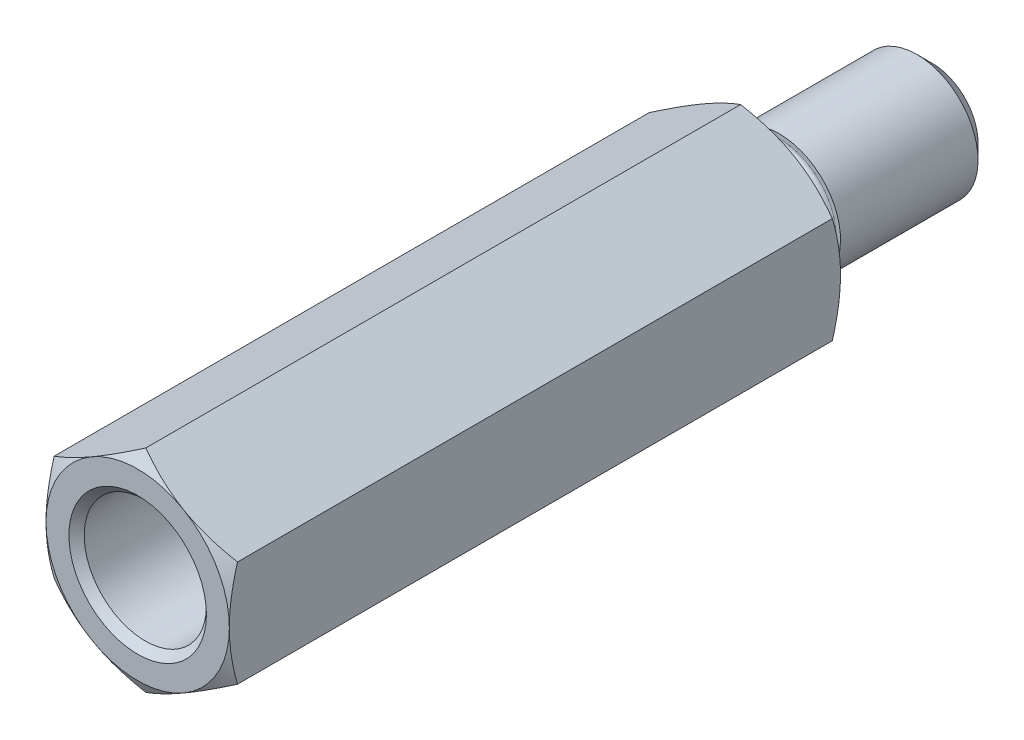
ISO-10303-21;
HEADER;
FILE_DESCRIPTION(('STEP AP214'),'2;1');
FILE_NAME('part.step','',(''),(''),'','','');
FILE_SCHEMA(('AUTOMOTIVE_DESIGN { 1 0 10303 214 1 1 1 1 }'));
ENDSEC;
DATA;
#1=APPLICATION_CONTEXT('core data for automotive mechanical design processes');
#2=APPLICATION_PROTOCOL_DEFINITION('international standard','automotive_design',2000,#1);
#3=PRODUCT_CONTEXT('',#1,'mechanical');
#4=PRODUCT('Part','Part','',(#3));
#5=PRODUCT_RELATED_PRODUCT_CATEGORY('part','',(#4));
#6=PRODUCT_DEFINITION_FORMATION('','',#4);
#7=PRODUCT_DEFINITION_CONTEXT('part definition',#1,'design');
#8=PRODUCT_DEFINITION('design','',#6,#7);
#9=PRODUCT_DEFINITION_SHAPE('','',#8);
#10=(LENGTH_UNIT() NAMED_UNIT(*) SI_UNIT(.MILLI.,.METRE.));
#11=(NAMED_UNIT(*) PLANE_ANGLE_UNIT() SI_UNIT($,.RADIAN.));
#12=(NAMED_UNIT(*) SI_UNIT($,.STERADIAN.) SOLID_ANGLE_UNIT());
#13=UNCERTAINTY_MEASURE_WITH_UNIT(LENGTH_MEASURE(1.E-05),#10,'distance_accuracy_value','');
#14=(GEOMETRIC_REPRESENTATION_CONTEXT(3) GLOBAL_UNCERTAINTY_ASSIGNED_CONTEXT((#13)) GLOBAL_UNIT_ASSIGNED_CONTEXT((#10,
#11,#12)) REPRESENTATION_CONTEXT('',''));
#15=CARTESIAN_POINT('',(0.,0.,0.));
#16=DIRECTION('',(0.,0.,1.));
#17=DIRECTION('',(1.,0.,0.));
#18=AXIS2_PLACEMENT_3D('',#15,#16,#17);
#19=CARTESIAN_POINT('',(0.,17.3205080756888,0.));
#20=DIRECTION('',(0.,0.,1.));
#21=DIRECTION('',(1.,0.,0.));
#22=AXIS2_PLACEMENT_3D('',#19,#20,#21);
#23=PLANE('',#22);
#24=CARTESIAN_POINT('',(0.,0.,0.));
#25=DIRECTION('',(0.,0.,-1.));
#26=DIRECTION('',(-1.,0.,0.));
#27=AXIS2_PLACEMENT_3D('',#24,#25,#26);
#28=CIRCLE('',#27,15.);
#29=CARTESIAN_POINT('',(7.5,12.9903810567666,0.));
#30=VERTEX_POINT('',#29);
#31=CARTESIAN_POINT('',(15.,0.,0.));
#32=VERTEX_POINT('',#31);
#33=EDGE_CURVE('E43',#30,#32,#28,.T.);
#34=ORIENTED_EDGE('',*,*,#33,.T.);
#35=CARTESIAN_POINT('',(7.5,-12.9903810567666,0.));
#36=VERTEX_POINT('',#35);
#37=EDGE_CURVE('E141',#32,#36,#28,.T.);
#38=ORIENTED_EDGE('',*,*,#37,.T.);
#39=CARTESIAN_POINT('',(-7.5,-12.9903810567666,0.));
#40=VERTEX_POINT('',#39);
#41=EDGE_CURVE('E140',#36,#40,#28,.T.);
#42=ORIENTED_EDGE('',*,*,#41,.T.);
#43=CARTESIAN_POINT('',(-15.,0.,0.));
#44=VERTEX_POINT('',#43);
#45=EDGE_CURVE('E121',#40,#44,#28,.T.);
#46=ORIENTED_EDGE('',*,*,#45,.T.);
#47=CARTESIAN_POINT('',(-7.5,12.9903810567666,0.));
#48=VERTEX_POINT('',#47);
#49=EDGE_CURVE('E109',#44,#48,#28,.T.);
#50=ORIENTED_EDGE('',*,*,#49,.T.);
#51=EDGE_CURVE('E35',#48,#30,#28,.T.);
#52=ORIENTED_EDGE('',*,*,#51,.T.);
#53=EDGE_LOOP('',(#34,#38,#42,#46,#50,#52));
#54=FACE_BOUND('',#53,.T.);
#55=CARTESIAN_POINT('',(0.,0.,0.));
#56=DIRECTION('',(0.,0.,1.));
#57=DIRECTION('',(1.,0.,0.));
#58=AXIS2_PLACEMENT_3D('',#55,#56,#57);
#59=CIRCLE('',#58,9.3);
#60=CARTESIAN_POINT('',(9.3,0.,0.));
#61=VERTEX_POINT('',#60);
#62=EDGE_CURVE('E265',#61,#61,#59,.T.);
#63=ORIENTED_EDGE('',*,*,#62,.T.);
#64=EDGE_LOOP('',(#63));
#65=FACE_BOUND('',#64,.T.);
#66=ADVANCED_FACE('F14',(#54,#65),#23,.F.);
#67=CARTESIAN_POINT('',(0.,0.,-30.));
#68=DIRECTION('',(0.,0.,-1.));
#69=DIRECTION('',(0.,1.,0.));
#70=AXIS2_PLACEMENT_3D('',#67,#68,#69);
#71=CYLINDRICAL_SURFACE('',#70,8.5);
#72=CARTESIAN_POINT('',(0.,0.,-4.2));
#73=DIRECTION('',(0.,0.,1.));
#74=DIRECTION('',(0.,-1.,0.));
#75=AXIS2_PLACEMENT_3D('',#72,#73,#74);
#76=CIRCLE('',#75,8.5);
#77=CARTESIAN_POINT('',(0.,-8.5,-4.2));
#78=VERTEX_POINT('',#77);
#79=EDGE_CURVE('E262',#78,#78,#76,.T.);
#80=ORIENTED_EDGE('',*,*,#79,.T.);
#81=EDGE_LOOP('',(#80));
#82=FACE_BOUND('',#81,.T.);
#83=CARTESIAN_POINT('',(0.,0.,-0.8));
#84=DIRECTION('',(0.,0.,1.));
#85=DIRECTION('',(1.,0.,0.));
#86=AXIS2_PLACEMENT_3D('',#83,#84,#85);
#87=CIRCLE('',#86,8.5);
#88=CARTESIAN_POINT('',(8.5,0.,-0.8));
#89=VERTEX_POINT('',#88);
#90=EDGE_CURVE('E259',#89,#89,#87,.F.);
#91=ORIENTED_EDGE('',*,*,#90,.T.);
#92=EDGE_LOOP('',(#91));
#93=FACE_BOUND('',#92,.T.);
#94=ADVANCED_FACE('F330',(#82,#93),#71,.T.);
#95=CARTESIAN_POINT('',(0.,8.5,-5.));
#96=DIRECTION('',(0.,0.,1.));
#97=DIRECTION('',(0.,-1.,0.));
#98=AXIS2_PLACEMENT_3D('',#95,#96,#97);
#99=PLANE('',#98);
#100=CARTESIAN_POINT('',(0.,0.,-5.));
#101=DIRECTION('',(0.,0.,1.));
#102=DIRECTION('',(0.,-1.,0.));
#103=AXIS2_PLACEMENT_3D('',#100,#101,#102);
#104=CIRCLE('',#103,9.3);
#105=CARTESIAN_POINT('',(0.,-9.3,-5.));
#106=VERTEX_POINT('',#105);
#107=EDGE_CURVE('E256',#106,#106,#104,.F.);
#108=ORIENTED_EDGE('',*,*,#107,.T.);
#109=EDGE_LOOP('',(#108));
#110=FACE_BOUND('',#109,.T.);
#111=CARTESIAN_POINT('',(0.,0.,-5.));
#112=DIRECTION('',(0.,0.,-1.));
#113=DIRECTION('',(0.,1.,0.));
#114=AXIS2_PLACEMENT_3D('',#111,#112,#113);
#115=CIRCLE('',#114,10.);
#116=CARTESIAN_POINT('',(0.,10.,-5.));
#117=VERTEX_POINT('',#116);
#118=EDGE_CURVE('E238',#117,#117,#115,.T.);
#119=ORIENTED_EDGE('',*,*,#118,.F.);
#120=EDGE_LOOP('',(#119));
#121=FACE_BOUND('',#120,.T.);
#122=ADVANCED_FACE('F335',(#110,#121),#99,.T.);
#123=CARTESIAN_POINT('',(0.,0.,-30.));
#124=DIRECTION('',(0.,0.,-1.));
#125=DIRECTION('',(0.,1.,0.));
#126=AXIS2_PLACEMENT_3D('',#123,#124,#125);
#127=CYLINDRICAL_SURFACE('',#126,10.);
#128=ORIENTED_EDGE('',*,*,#118,.T.);
#129=EDGE_LOOP('',(#128));
#130=FACE_BOUND('',#129,.T.);
#131=CARTESIAN_POINT('',(0.,0.,-27.5));
#132=DIRECTION('',(0.,0.,-1.));
#133=DIRECTION('',(0.,1.,0.));
#134=AXIS2_PLACEMENT_3D('',#131,#132,#133);
#135=CIRCLE('',#134,10.);
#136=CARTESIAN_POINT('',(0.,10.,-27.5));
#137=VERTEX_POINT('',#136);
#138=EDGE_CURVE('E235',#137,#137,#135,.T.);
#139=ORIENTED_EDGE('',*,*,#138,.F.);
#140=EDGE_LOOP('',(#139));
#141=FACE_BOUND('',#140,.T.);
#142=ADVANCED_FACE('F518',(#130,#141),#127,.T.);
#143=CARTESIAN_POINT('',(0.,0.,-30.));
#144=DIRECTION('',(0.,0.,1.));
#145=DIRECTION('',(0.,-1.,0.));
#146=AXIS2_PLACEMENT_3D('',#143,#144,#145);
#147=CONICAL_SURFACE('',#146,7.5,0.78539816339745);
#148=ORIENTED_EDGE('',*,*,#138,.T.);
#149=EDGE_LOOP('',(#148));
#150=FACE_BOUND('',#149,.T.);
#151=CARTESIAN_POINT('',(0.,0.,-30.));
#152=DIRECTION('',(0.,0.,-1.));
#153=DIRECTION('',(0.,1.,0.));
#154=AXIS2_PLACEMENT_3D('',#151,#152,#153);
#155=CIRCLE('',#154,7.5);
#156=CARTESIAN_POINT('',(0.,7.5,-30.));
#157=VERTEX_POINT('',#156);
#158=EDGE_CURVE('E232',#157,#157,#155,.T.);
#159=ORIENTED_EDGE('',*,*,#158,.F.);
#160=EDGE_LOOP('',(#159));
#161=FACE_BOUND('',#160,.T.);
#162=ADVANCED_FACE('F508',(#150,#161),#147,.T.);
#163=CARTESIAN_POINT('',(0.,7.5,-30.));
#164=DIRECTION('',(0.,0.,-1.));
#165=DIRECTION('',(0.,1.,0.));
#166=AXIS2_PLACEMENT_3D('',#163,#164,#165);
#167=PLANE('',#166);
#168=ORIENTED_EDGE('',*,*,#158,.T.);
#169=EDGE_LOOP('',(#168));
#170=FACE_BOUND('',#169,.T.);
#171=ADVANCED_FACE('F499',(#170),#167,.T.);
#172=CARTESIAN_POINT('',(0.,0.,-4.2));
#173=DIRECTION('',(0.,0.,1.));
#174=DIRECTION('',(0.,-1.,0.));
#175=AXIS2_PLACEMENT_3D('',#172,#173,#174);
#176=TOROIDAL_SURFACE('',#175,9.3,0.8);
#177=ORIENTED_EDGE('',*,*,#79,.F.);
#178=EDGE_LOOP('',(#177));
#179=FACE_BOUND('',#178,.T.);
#180=ORIENTED_EDGE('',*,*,#107,.F.);
#181=EDGE_LOOP('',(#180));
#182=FACE_BOUND('',#181,.T.);
#183=ADVANCED_FACE('F490',(#179,#182),#176,.F.);
#184=CARTESIAN_POINT('',(0.,0.,-0.8));
#185=DIRECTION('',(0.,0.,1.));
#186=DIRECTION('',(1.,0.,0.));
#187=AXIS2_PLACEMENT_3D('',#184,#185,#186);
#188=TOROIDAL_SURFACE('',#187,9.3,0.8);
#189=ORIENTED_EDGE('',*,*,#62,.F.);
#190=EDGE_LOOP('',(#189));
#191=FACE_BOUND('',#190,.T.);
#192=ORIENTED_EDGE('',*,*,#90,.F.);
#193=EDGE_LOOP('',(#192));
#194=FACE_BOUND('',#193,.T.);
#195=ADVANCED_FACE('F16',(#191,#194),#188,.F.);
#196=CARTESIAN_POINT('',(0.,0.,4.18828075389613));
#197=DIRECTION('',(0.,0.,1.));
#198=DIRECTION('',(1.,0.,0.));
#199=AXIS2_PLACEMENT_3D('',#196,#197,#198);
#200=CONICAL_SURFACE('',#199,22.2543150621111,1.0471975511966);
#201=CARTESIAN_POINT('',(-15.0002,-8.66013856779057,1.33981262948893));
#202=CARTESIAN_POINT('',(-14.6705058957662,-8.85048754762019,1.22992178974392));
#203=CARTESIAN_POINT('',(-14.3395258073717,-9.04157899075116,1.12501758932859));
#204=CARTESIAN_POINT('',(-13.674911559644,-9.42529420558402,0.92656858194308));
#205=CARTESIAN_POINT('',(-13.3412765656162,-9.61791845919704,0.833027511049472));
#206=CARTESIAN_POINT('',(-12.6707077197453,-10.0050715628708,0.658562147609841));
#207=CARTESIAN_POINT('',(-12.333767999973,-10.199603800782,0.577667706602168));
#208=CARTESIAN_POINT('',(-11.6575472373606,-10.5900200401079,0.430232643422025));
#209=CARTESIAN_POINT('',(-11.3182663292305,-10.7859039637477,0.363691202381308));
#210=CARTESIAN_POINT('',(-10.6460568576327,-11.1740042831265,0.24779237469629));
#211=CARTESIAN_POINT('',(-10.3131781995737,-11.3661918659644,0.198051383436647));
#212=CARTESIAN_POINT('',(-9.64589556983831,-11.7514476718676,0.11464674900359));
#213=CARTESIAN_POINT('',(-9.31149156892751,-11.9445159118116,0.0809834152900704));
#214=CARTESIAN_POINT('',(-8.64212181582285,-12.3309767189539,0.030584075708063));
#215=CARTESIAN_POINT('',(-8.30715720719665,-12.5243686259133,0.0138279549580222));
#216=CARTESIAN_POINT('',(-7.63691878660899,-12.9113309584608,-0.00239660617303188));
#217=CARTESIAN_POINT('',(-7.30164498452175,-13.1049013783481,-0.00186558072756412));
#218=CARTESIAN_POINT('',(-6.67485311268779,-13.4667798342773,0.01527661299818));
#219=CARTESIAN_POINT('',(-6.38329037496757,-13.6351136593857,0.0297968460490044));
#220=CARTESIAN_POINT('',(-5.80083556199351,-13.9713941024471,0.0716371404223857));
#221=CARTESIAN_POINT('',(-5.5099435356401,-14.1393406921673,0.0989581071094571));
#222=CARTESIAN_POINT('',(-4.92898814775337,-14.4747554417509,0.16592351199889));
#223=CARTESIAN_POINT('',(-4.63892567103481,-14.6422230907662,0.205578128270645));
#224=CARTESIAN_POINT('',(-4.06016058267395,-14.9763732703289,0.296515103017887));
#225=CARTESIAN_POINT('',(-3.77145806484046,-15.1430557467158,0.347798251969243));
#226=CARTESIAN_POINT('',(-2.89508556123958,-15.6490296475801,0.520386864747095));
#227=CARTESIAN_POINT('',(-2.30995340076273,-15.9868558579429,0.658901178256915));
#228=CARTESIAN_POINT('',(-1.14841408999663,-16.6574708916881,0.973271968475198));
#229=CARTESIAN_POINT('',(-0.571992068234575,-16.9902683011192,1.14905461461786));
#230=CARTESIAN_POINT('',(0.000200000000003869,-17.3206235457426,1.33981262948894));
#231=B_SPLINE_CURVE_WITH_KNOTS('',3,(#201,#202,#203,#204,#205,#206,#207,#208,#209,#210,#211,
#212,#213,#214,#215,#216,#217,#218,#219,#220,#221,#222,#223,#224,#225,#226,#227,#228,#229,#230),
.UNSPECIFIED.,.F.,.F.,(4,2,2,2,2,2,2,2,2,2,2,2,2,2,4),(0.,1.18875411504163,2.37789802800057,
3.56980778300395,4.76164951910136,5.92407379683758,7.08652044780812,8.24758247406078,
9.40860862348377,10.4193068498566,11.4300765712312,12.4416826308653,13.4533574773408,
15.5211962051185,17.5849760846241),.UNSPECIFIED.);
#232=CARTESIAN_POINT('',(0.,-17.3205080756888,1.33974596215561));
#233=VERTEX_POINT('',#232);
#234=EDGE_CURVE('E18',#40,#233,#231,.T.);
#235=ORIENTED_EDGE('',*,*,#234,.F.);
#236=ORIENTED_EDGE('',*,*,#41,.F.);
#237=CARTESIAN_POINT('',(-0.000199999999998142,-17.3206235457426,1.33981262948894));
#238=CARTESIAN_POINT('',(0.329494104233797,-17.130274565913,1.22992178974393));
#239=CARTESIAN_POINT('',(0.660474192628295,-16.9391831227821,1.1250175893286));
#240=CARTESIAN_POINT('',(1.32508844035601,-16.5554679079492,0.92656858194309));
#241=CARTESIAN_POINT('',(1.6587234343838,-16.3628436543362,0.833027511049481));
#242=CARTESIAN_POINT('',(2.32929228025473,-15.9756905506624,0.658562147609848));
#243=CARTESIAN_POINT('',(2.66623200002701,-15.7811583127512,0.577667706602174));
#244=CARTESIAN_POINT('',(3.34245276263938,-15.3907420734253,0.43023264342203));
#245=CARTESIAN_POINT('',(3.68173367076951,-15.1948581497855,0.363691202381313));
#246=CARTESIAN_POINT('',(4.35394314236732,-14.8067578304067,0.247792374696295));
#247=CARTESIAN_POINT('',(4.68682180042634,-14.6145702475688,0.198051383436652));
#248=CARTESIAN_POINT('',(5.3541044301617,-14.2293144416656,0.114646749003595));
#249=CARTESIAN_POINT('',(5.6885084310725,-14.0362462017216,0.0809834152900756));
#250=CARTESIAN_POINT('',(6.35787818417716,-13.6497853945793,0.0305840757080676));
#251=CARTESIAN_POINT('',(6.69284279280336,-13.4563934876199,0.013827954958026));
#252=CARTESIAN_POINT('',(7.36308121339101,-13.0694311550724,-0.00239660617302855));
#253=CARTESIAN_POINT('',(7.69835501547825,-12.8758607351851,-0.00186558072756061));
#254=CARTESIAN_POINT('',(8.32514688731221,-12.5139822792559,0.0152766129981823));
#255=CARTESIAN_POINT('',(8.61670962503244,-12.3456484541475,0.0297968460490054));
#256=CARTESIAN_POINT('',(9.19916443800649,-12.0093680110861,0.0716371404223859));
#257=CARTESIAN_POINT('',(9.4900564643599,-11.8414214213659,0.098958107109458));
#258=CARTESIAN_POINT('',(10.0710118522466,-11.5060066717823,0.165923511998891));
#259=CARTESIAN_POINT('',(10.3610743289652,-11.338539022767,0.205578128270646));
#260=CARTESIAN_POINT('',(10.939839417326,-11.0043888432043,0.296515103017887));
#261=CARTESIAN_POINT('',(11.2285419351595,-10.8377063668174,0.347798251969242));
#262=CARTESIAN_POINT('',(12.1049144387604,-10.3317324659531,0.520386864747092));
#263=CARTESIAN_POINT('',(12.6900465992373,-9.99390625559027,0.658901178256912));
#264=CARTESIAN_POINT('',(13.8515859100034,-9.32329122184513,0.973271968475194));
#265=CARTESIAN_POINT('',(14.4280079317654,-8.99049381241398,1.14905461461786));
#266=CARTESIAN_POINT('',(15.0002,-8.66013856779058,1.33981262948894));
#267=B_SPLINE_CURVE_WITH_KNOTS('',3,(#237,#238,#239,#240,#241,#242,#243,#244,#245,#246,#247,
#248,#249,#250,#251,#252,#253,#254,#255,#256,#257,#258,#259,#260,#261,#262,#263,#264,#265,#266),
.UNSPECIFIED.,.F.,.F.,(4,2,2,2,2,2,2,2,2,2,2,2,2,2,4),(0.,1.18875411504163,2.37789802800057,
3.56980778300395,4.76164951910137,5.9240737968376,7.08652044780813,8.2475824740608,
9.40860862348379,10.4193068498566,11.4300765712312,12.4416826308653,13.4533574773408,
15.5211962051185,17.5849760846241),.UNSPECIFIED.);
#268=EDGE_CURVE('E119',#233,#36,#267,.T.);
#269=ORIENTED_EDGE('',*,*,#268,.F.);
#270=EDGE_LOOP('',(#235,#236,#269));
#271=FACE_BOUND('',#270,.T.);
#272=ADVANCED_FACE('F164',(#271),#200,.T.);
#273=ORIENTED_EDGE('',*,*,#45,.F.);
#274=CARTESIAN_POINT('',(-15.,-8.66025403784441,1.33974596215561));
#275=VERTEX_POINT('',#274);
#276=EDGE_CURVE('E9',#275,#40,#231,.T.);
#277=ORIENTED_EDGE('',*,*,#276,.F.);
#278=CARTESIAN_POINT('',(-15.,-23.365725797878,7.37051993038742));
#279=CARTESIAN_POINT('',(-15.,-23.0377344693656,7.21116798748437));
#280=CARTESIAN_POINT('',(-15.,-22.7093610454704,7.05260287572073));
#281=CARTESIAN_POINT('',(-15.,-22.0517703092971,6.73722430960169));
#282=CARTESIAN_POINT('',(-15.,-21.7225529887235,6.58041087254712));
#283=CARTESIAN_POINT('',(-15.,-20.7334293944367,6.11282440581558));
#284=CARTESIAN_POINT('',(-15.,-20.0721469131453,5.80495170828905));
#285=CARTESIAN_POINT('',(-15.,-18.7416415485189,5.19714702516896));
#286=CARTESIAN_POINT('',(-15.,-18.0723950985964,4.89726650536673));
#287=CARTESIAN_POINT('',(-15.,-16.7286161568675,4.30963504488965));
#288=CARTESIAN_POINT('',(-15.,-16.0540839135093,4.0218835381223));
#289=CARTESIAN_POINT('',(-15.,-14.6764610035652,3.45254159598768));
#290=CARTESIAN_POINT('',(-15.,-13.9731583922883,3.17146135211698));
#291=CARTESIAN_POINT('',(-15.,-12.5583581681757,2.63032407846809));
#292=CARTESIAN_POINT('',(-15.,-11.846859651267,2.37026939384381));
#293=CARTESIAN_POINT('',(-15.,-10.4158574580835,1.87793885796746));
#294=CARTESIAN_POINT('',(-15.,-9.69637298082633,1.64560764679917));
#295=CARTESIAN_POINT('',(-15.,-8.24701556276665,1.21609750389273));
#296=CARTESIAN_POINT('',(-15.,-7.51714593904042,1.01890760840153));
#297=CARTESIAN_POINT('',(-15.,-6.41644938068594,0.757105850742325));
#298=CARTESIAN_POINT('',(-15.,-6.04959755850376,0.675682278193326));
#299=CARTESIAN_POINT('',(-15.,-5.31336816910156,0.52512160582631));
#300=CARTESIAN_POINT('',(-15.,-4.94399065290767,0.455984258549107));
#301=CARTESIAN_POINT('',(-15.,-4.20295611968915,0.331209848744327));
#302=CARTESIAN_POINT('',(-15.,-3.83129913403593,0.275572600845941));
#303=CARTESIAN_POINT('',(-15.,-3.08609352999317,0.178904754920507));
#304=CARTESIAN_POINT('',(-15.,-2.71254499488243,0.137873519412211));
#305=CARTESIAN_POINT('',(-15.,-1.96899776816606,0.0717526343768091));
#306=CARTESIAN_POINT('',(-15.,-1.5990172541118,0.0464598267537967));
#307=CARTESIAN_POINT('',(-15.,-0.858318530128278,0.0115485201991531));
#308=CARTESIAN_POINT('',(-15.,-0.487600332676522,0.00192975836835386));
#309=CARTESIAN_POINT('',(-15.,0.253911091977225,-0.00140427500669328));
#310=CARTESIAN_POINT('',(-15.,0.624704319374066,0.00488049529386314));
#311=CARTESIAN_POINT('',(-15.,1.36569308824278,0.0331989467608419));
#312=CARTESIAN_POINT('',(-15.,1.73588860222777,0.0552333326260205));
#313=CARTESIAN_POINT('',(-15.,2.6224818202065,0.126394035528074));
#314=CARTESIAN_POINT('',(-15.,3.13830411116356,0.182820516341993));
#315=CARTESIAN_POINT('',(-15.,4.16619119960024,0.323202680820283));
#316=CARTESIAN_POINT('',(-15.,4.67825548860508,0.407162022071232));
#317=CARTESIAN_POINT('',(-15.,5.69811458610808,0.599623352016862));
#318=CARTESIAN_POINT('',(-15.,6.2059058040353,0.708144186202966));
#319=CARTESIAN_POINT('',(-15.,7.21642914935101,0.946410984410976));
#320=CARTESIAN_POINT('',(-15.,7.7191613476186,1.07615665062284));
#321=CARTESIAN_POINT('',(-15.,8.7306710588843,1.35678973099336));
#322=CARTESIAN_POINT('',(-15.,9.23933542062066,1.50808216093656));
#323=CARTESIAN_POINT('',(-15.,10.2516547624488,1.8265035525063));
#324=CARTESIAN_POINT('',(-15.,10.7553097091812,1.99363261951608));
#325=CARTESIAN_POINT('',(-15.,11.7578554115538,2.34105578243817));
#326=CARTESIAN_POINT('',(-15.,12.2567476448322,2.52134563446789));
#327=CARTESIAN_POINT('',(-15.,13.2503847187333,2.89294928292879));
#328=CARTESIAN_POINT('',(-15.,13.7451296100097,3.08426294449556));
#329=CARTESIAN_POINT('',(-15.,14.9203756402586,3.55138416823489));
#330=CARTESIAN_POINT('',(-15.,15.5991980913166,3.83140904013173));
#331=CARTESIAN_POINT('',(-15.,16.9509838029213,4.40530196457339));
#332=CARTESIAN_POINT('',(-15.,17.623946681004,4.69917091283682));
#333=CARTESIAN_POINT('',(-15.,18.9651157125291,5.29795565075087));
#334=CARTESIAN_POINT('',(-15.,19.6333207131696,5.60287401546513));
#335=CARTESIAN_POINT('',(-15.,20.9656173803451,6.22150753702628));
#336=CARTESIAN_POINT('',(-15.,21.6297091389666,6.53522249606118));
#337=CARTESIAN_POINT('',(-15.,22.9552185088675,7.17014987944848));
#338=CARTESIAN_POINT('',(-15.,23.6166322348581,7.49137040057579));
#339=CARTESIAN_POINT('',(-15.,24.9365798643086,8.13967386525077));
#340=CARTESIAN_POINT('',(-15.,25.5951137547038,8.46675683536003));
#341=CARTESIAN_POINT('',(-15.,26.9096589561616,9.12572769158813));
#342=CARTESIAN_POINT('',(-15.,27.5656705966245,9.4576149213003));
#343=CARTESIAN_POINT('',(-15.,28.875627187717,10.1254454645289));
#344=CARTESIAN_POINT('',(-15.,29.529572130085,10.4613887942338));
#345=CARTESIAN_POINT('',(-15.,31.377559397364,11.4168260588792));
#346=CARTESIAN_POINT('',(-15.,32.5695365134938,12.0403143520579));
#347=CARTESIAN_POINT('',(-15.,34.9490520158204,13.2957901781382));
#348=CARTESIAN_POINT('',(-15.,36.1365902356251,13.9277780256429));
#349=CARTESIAN_POINT('',(-15.,38.5051377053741,15.196618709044));
#350=CARTESIAN_POINT('',(-15.,39.6861558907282,15.8334548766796));
#351=CARTESIAN_POINT('',(-15.,41.4555932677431,16.7924807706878));
#352=CARTESIAN_POINT('',(-15.,42.0450409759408,17.1127756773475));
#353=CARTESIAN_POINT('',(-15.,43.2233192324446,17.7544965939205));
#354=CARTESIAN_POINT('',(-15.,43.8121497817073,18.0759226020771));
#355=CARTESIAN_POINT('',(-15.,44.4007068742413,18.3978486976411));
#356=B_SPLINE_CURVE_WITH_KNOTS('',3,(#278,#279,#280,#281,#282,#283,#284,#285,#286,#287,#288,
#289,#290,#291,#292,#293,#294,#295,#296,#297,#298,#299,#300,#301,#302,#303,#304,#305,#306,#307,
#308,#309,#310,#311,#312,#313,#314,#315,#316,#317,#318,#319,#320,#321,#322,#323,#324,#325,#326,
#327,#328,#329,#330,#331,#332,#333,#334,#335,#336,#337,#338,#339,#340,#341,#342,#343,#344,#345,
#346,#347,#348,#349,#350,#351,#352,#353,#354,#355),.UNSPECIFIED.,.F.,.F.,(4,2,2,2,2,2,2,2,2,2,2,
2,2,2,2,2,2,2,2,2,2,2,2,2,2,2,2,2,2,2,2,2,2,2,2,2,2,2,4),(0.,1.09395517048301,2.18792113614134,
4.37617148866,6.57616225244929,8.77605022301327,11.0479656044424,13.3201340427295,
15.5876865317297,17.854530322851,18.9816956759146,20.1088383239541,21.2359654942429,
22.3630434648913,23.4752532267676,24.5874443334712,25.6996383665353,26.8118821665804,
28.3677217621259,29.9237681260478,31.4810124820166,33.0382349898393,34.629988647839,
36.2217528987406,37.8130061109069,39.4042398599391,41.606965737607,43.809834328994,
46.0132196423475,48.2165554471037,50.4223892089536,52.628232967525,54.8337781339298,
57.0393321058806,61.0748622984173,65.1105422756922,69.1358550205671,71.1483989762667,
73.1609398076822),.UNSPECIFIED.);
#357=EDGE_CURVE('E124',#44,#275,#356,.F.);
#358=ORIENTED_EDGE('',*,*,#357,.F.);
#359=EDGE_LOOP('',(#273,#277,#358));
#360=FACE_BOUND('',#359,.T.);
#361=ADVANCED_FACE('F125',(#360),#200,.T.);
#362=CARTESIAN_POINT('',(15.,-8.66025403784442,1.33974596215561));
#363=VERTEX_POINT('',#362);
#364=EDGE_CURVE('E136',#36,#363,#267,.T.);
#365=ORIENTED_EDGE('',*,*,#364,.F.);
#366=ORIENTED_EDGE('',*,*,#37,.F.);
#367=CARTESIAN_POINT('',(15.,-23.3657257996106,7.37051993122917));
#368=CARTESIAN_POINT('',(15.,-23.0377344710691,7.21116798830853));
#369=CARTESIAN_POINT('',(15.,-22.7093610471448,7.05260287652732));
#370=CARTESIAN_POINT('',(15.,-22.0517703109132,6.73722431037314));
#371=CARTESIAN_POINT('',(15.,-21.7225529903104,6.58041087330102));
#372=CARTESIAN_POINT('',(15.,-20.733429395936,6.11282440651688));
#373=CARTESIAN_POINT('',(15.,-20.0721469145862,5.80495170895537));
#374=CARTESIAN_POINT('',(15.,-18.741641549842,5.19714702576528));
#375=CARTESIAN_POINT('',(15.,-18.0723950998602,4.89726650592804));
#376=CARTESIAN_POINT('',(15.,-16.7286161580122,4.30963504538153));
#377=CARTESIAN_POINT('',(15.,-16.0540839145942,4.02188353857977));
#378=CARTESIAN_POINT('',(15.,-14.6764610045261,3.45254159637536));
#379=CARTESIAN_POINT('',(15.,-13.9731583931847,3.17146135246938));
#380=CARTESIAN_POINT('',(15.,-12.5583581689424,2.63032407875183));
#381=CARTESIAN_POINT('',(15.,-11.8468596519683,2.37026939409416));
#382=CARTESIAN_POINT('',(15.,-10.4158574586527,1.87793885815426));
#383=CARTESIAN_POINT('',(15.,-9.69637298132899,1.6456076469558));
#384=CARTESIAN_POINT('',(15.,-8.24701556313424,1.216097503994));
#385=CARTESIAN_POINT('',(15.,-7.51714593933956,1.01890760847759));
#386=CARTESIAN_POINT('',(15.,-6.41644938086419,0.757105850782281));
#387=CARTESIAN_POINT('',(15.,-6.04959755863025,0.675682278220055));
#388=CARTESIAN_POINT('',(15.,-5.31336816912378,0.525121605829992));
#389=CARTESIAN_POINT('',(15.,-4.94399065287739,0.45598425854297));
#390=CARTESIAN_POINT('',(15.,-4.2029561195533,0.331209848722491));
#391=CARTESIAN_POINT('',(15.,-3.83129913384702,0.27557260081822));
#392=CARTESIAN_POINT('',(15.,-3.08609352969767,0.17890475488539));
#393=CARTESIAN_POINT('',(15.,-2.71254499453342,0.137873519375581));
#394=CARTESIAN_POINT('',(15.,-1.96899776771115,0.0717526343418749));
#395=CARTESIAN_POINT('',(15.,-1.59901725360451,0.0464598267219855));
#396=CARTESIAN_POINT('',(15.,-0.858318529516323,0.0115485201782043));
#397=CARTESIAN_POINT('',(15.,-0.487600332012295,0.00192975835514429));
#398=CARTESIAN_POINT('',(15.,0.253911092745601,-0.00140427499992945));
#399=CARTESIAN_POINT('',(15.,0.624704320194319,0.00488049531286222));
#400=CARTESIAN_POINT('',(15.,1.3656930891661,0.0331989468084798));
#401=CARTESIAN_POINT('',(15.,1.73588860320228,0.055233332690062));
#402=CARTESIAN_POINT('',(15.,2.62248182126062,0.126394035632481));
#403=CARTESIAN_POINT('',(15.,3.1383041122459,0.182820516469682));
#404=CARTESIAN_POINT('',(15.,4.16619120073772,0.323202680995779));
#405=CARTESIAN_POINT('',(15.,4.6782554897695,0.407162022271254));
#406=CARTESIAN_POINT('',(15.,5.69811458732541,0.599623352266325));
#407=CARTESIAN_POINT('',(15.,6.2059058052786,0.708144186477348));
#408=CARTESIAN_POINT('',(15.,7.21642915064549,0.946410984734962));
#409=CARTESIAN_POINT('',(15.,7.7191613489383,1.07615665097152));
#410=CARTESIAN_POINT('',(15.,8.7306710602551,1.35678973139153));
#411=CARTESIAN_POINT('',(15.,9.23933542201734,1.50808216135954));
#412=CARTESIAN_POINT('',(15.,10.2516547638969,1.82650355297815));
#413=CARTESIAN_POINT('',(15.,10.755309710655,1.99363262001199));
#414=CARTESIAN_POINT('',(15.,11.7578554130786,2.34105578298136));
#415=CARTESIAN_POINT('',(15.,12.2567476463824,2.52134563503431));
#416=CARTESIAN_POINT('',(15.,13.2503847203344,2.89294928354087));
#417=CARTESIAN_POINT('',(15.,13.7451296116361,3.08426294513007));
#418=CARTESIAN_POINT('',(15.,14.9203756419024,3.5513841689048));
#419=CARTESIAN_POINT('',(15.,15.5991980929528,3.83140904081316));
#420=CARTESIAN_POINT('',(15.,16.9509838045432,4.40530196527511));
#421=CARTESIAN_POINT('',(15.,17.6239466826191,4.69917091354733));
#422=CARTESIAN_POINT('',(15.,18.9651157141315,5.29795565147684));
#423=CARTESIAN_POINT('',(15.,19.6333207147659,5.60287401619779));
#424=CARTESIAN_POINT('',(15.,20.96561738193,6.22150753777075));
#425=CARTESIAN_POINT('',(15.,21.6297091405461,6.53522249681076));
#426=CARTESIAN_POINT('',(15.,22.9552185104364,7.17014988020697));
#427=CARTESIAN_POINT('',(15.,23.6166322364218,7.49137040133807));
#428=CARTESIAN_POINT('',(15.,24.9365798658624,8.1396738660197));
#429=CARTESIAN_POINT('',(15.,25.5951137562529,8.46675683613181));
#430=CARTESIAN_POINT('',(15.,26.9096589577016,9.12572769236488));
#431=CARTESIAN_POINT('',(15.,27.5656705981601,9.45761492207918));
#432=CARTESIAN_POINT('',(15.,28.8756271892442,10.1254454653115));
#433=CARTESIAN_POINT('',(15.,29.5295721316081,10.4613887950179));
#434=CARTESIAN_POINT('',(15.,31.3775593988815,11.41682605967));
#435=CARTESIAN_POINT('',(15.,32.5695365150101,12.0403143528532));
#436=CARTESIAN_POINT('',(15.,34.9490520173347,13.2957901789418));
#437=CARTESIAN_POINT('',(15.,36.1365902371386,13.9277780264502));
#438=CARTESIAN_POINT('',(15.,38.5051377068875,15.1966187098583));
#439=CARTESIAN_POINT('',(15.,39.6861558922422,15.8334548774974));
#440=CARTESIAN_POINT('',(15.,41.4555932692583,16.7924807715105));
#441=CARTESIAN_POINT('',(15.,42.0450409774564,17.1127756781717));
#442=CARTESIAN_POINT('',(15.,43.2233192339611,17.7544965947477));
#443=CARTESIAN_POINT('',(15.,43.8121497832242,18.0759226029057));
#444=CARTESIAN_POINT('',(15.,44.4007068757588,18.3978486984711));
#445=B_SPLINE_CURVE_WITH_KNOTS('',3,(#367,#368,#369,#370,#371,#372,#373,#374,#375,#376,#377,
#378,#379,#380,#381,#382,#383,#384,#385,#386,#387,#388,#389,#390,#391,#392,#393,#394,#395,#396,
#397,#398,#399,#400,#401,#402,#403,#404,#405,#406,#407,#408,#409,#410,#411,#412,#413,#414,#415,
#416,#417,#418,#419,#420,#421,#422,#423,#424,#425,#426,#427,#428,#429,#430,#431,#432,#433,#434,
#435,#436,#437,#438,#439,#440,#441,#442,#443,#444),.UNSPECIFIED.,.F.,.F.,(4,2,2,2,2,2,2,2,2,2,2,
2,2,2,2,2,2,2,2,2,2,2,2,2,2,2,2,2,2,2,2,2,2,2,2,2,2,2,4),(0.,1.09395517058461,2.18792113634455,
4.37617148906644,6.57616225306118,8.77605022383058,11.0479656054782,13.320134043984,
15.5876865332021,17.854530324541,18.9816956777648,20.1088383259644,21.2359654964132,
22.3630434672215,23.4752532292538,24.5874443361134,25.6996383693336,26.8118821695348,
28.367721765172,29.9237681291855,31.4810124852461,33.0382349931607,34.629988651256,
36.2217529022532,37.813006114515,39.4042398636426,41.6069657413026,43.8098343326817,
46.0132196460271,48.2165554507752,50.4223892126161,52.6282329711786,54.8337781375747,
57.0393321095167,61.0748623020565,65.1105422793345,69.135855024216,71.148398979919,
73.1609398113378),.UNSPECIFIED.);
#446=EDGE_CURVE('E174',#363,#32,#445,.T.);
#447=ORIENTED_EDGE('',*,*,#446,.F.);
#448=EDGE_LOOP('',(#365,#366,#447));
#449=FACE_BOUND('',#448,.T.);
#450=ADVANCED_FACE('F163',(#449),#200,.T.);
#451=CARTESIAN_POINT('',(15.,8.66025403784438,1.33974596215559));
#452=VERTEX_POINT('',#451);
#453=EDGE_CURVE('E360',#32,#452,#445,.T.);
#454=ORIENTED_EDGE('',*,*,#453,.F.);
#455=ORIENTED_EDGE('',*,*,#33,.F.);
#456=CARTESIAN_POINT('',(15.0002,8.66013856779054,1.33981262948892));
#457=CARTESIAN_POINT('',(14.6705058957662,8.85048754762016,1.22992178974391));
#458=CARTESIAN_POINT('',(14.3395258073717,9.04157899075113,1.12501758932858));
#459=CARTESIAN_POINT('',(13.674911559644,9.42529420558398,0.926568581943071));
#460=CARTESIAN_POINT('',(13.3412765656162,9.61791845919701,0.833027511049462));
#461=CARTESIAN_POINT('',(12.6707077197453,10.0050715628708,0.65856214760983));
#462=CARTESIAN_POINT('',(12.333767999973,10.199603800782,0.577667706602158));
#463=CARTESIAN_POINT('',(11.6575472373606,10.5900200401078,0.430232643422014));
#464=CARTESIAN_POINT('',(11.3182663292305,10.7859039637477,0.363691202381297));
#465=CARTESIAN_POINT('',(10.6460568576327,11.1740042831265,0.247792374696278));
#466=CARTESIAN_POINT('',(10.3131781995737,11.3661918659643,0.198051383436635));
#467=CARTESIAN_POINT('',(9.64589556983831,11.7514476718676,0.114646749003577));
#468=CARTESIAN_POINT('',(9.31149156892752,11.9445159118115,0.0809834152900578));
#469=CARTESIAN_POINT('',(8.64212181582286,12.3309767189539,0.0305840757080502));
#470=CARTESIAN_POINT('',(8.30715720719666,12.5243686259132,0.013827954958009));
#471=CARTESIAN_POINT('',(7.63691878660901,12.9113309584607,-0.00239660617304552));
#472=CARTESIAN_POINT('',(7.30164498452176,13.104901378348,-0.00186558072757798));
#473=CARTESIAN_POINT('',(6.6748531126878,13.4667798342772,0.0152766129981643));
#474=CARTESIAN_POINT('',(6.38329037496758,13.6351136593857,0.0297968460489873));
#475=CARTESIAN_POINT('',(5.80083556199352,13.971394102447,0.0716371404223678));
#476=CARTESIAN_POINT('',(5.50994353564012,14.1393406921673,0.0989581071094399));
#477=CARTESIAN_POINT('',(4.92898814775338,14.4747554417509,0.165923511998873));
#478=CARTESIAN_POINT('',(4.63892567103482,14.6422230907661,0.205578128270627));
#479=CARTESIAN_POINT('',(4.06016058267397,14.9763732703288,0.296515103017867));
#480=CARTESIAN_POINT('',(3.77145806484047,15.1430557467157,0.347798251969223));
#481=CARTESIAN_POINT('',(2.8950855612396,15.6490296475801,0.520386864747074));
#482=CARTESIAN_POINT('',(2.30995340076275,15.9868558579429,0.658901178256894));
#483=CARTESIAN_POINT('',(1.14841408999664,16.657470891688,0.973271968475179));
#484=CARTESIAN_POINT('',(0.571992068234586,16.9902683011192,1.14905461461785));
#485=CARTESIAN_POINT('',(-0.000199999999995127,17.3206235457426,1.33981262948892));
#486=B_SPLINE_CURVE_WITH_KNOTS('',3,(#456,#457,#458,#459,#460,#461,#462,#463,#464,#465,#466,
#467,#468,#469,#470,#471,#472,#473,#474,#475,#476,#477,#478,#479,#480,#481,#482,#483,#484,#485),
.UNSPECIFIED.,.F.,.F.,(4,2,2,2,2,2,2,2,2,2,2,2,2,2,4),(0.,1.18875411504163,2.37789802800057,
3.56980778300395,4.76164951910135,5.92407379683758,7.08652044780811,8.24758247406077,
9.40860862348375,10.4193068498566,11.4300765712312,12.4416826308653,13.4533574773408,
15.5211962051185,17.5849760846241),.UNSPECIFIED.);
#487=EDGE_CURVE('E301',#452,#30,#486,.T.);
#488=ORIENTED_EDGE('',*,*,#487,.F.);
#489=EDGE_LOOP('',(#454,#455,#488));
#490=FACE_BOUND('',#489,.T.);
#491=ADVANCED_FACE('F158',(#490),#200,.T.);
#492=ORIENTED_EDGE('',*,*,#51,.F.);
#493=CARTESIAN_POINT('',(0.000200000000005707,17.3206235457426,1.33981262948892));
#494=CARTESIAN_POINT('',(-0.329494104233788,17.130274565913,1.22992178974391));
#495=CARTESIAN_POINT('',(-0.660474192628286,16.939183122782,1.12501758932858));
#496=CARTESIAN_POINT('',(-1.325088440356,16.5554679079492,0.926568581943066));
#497=CARTESIAN_POINT('',(-1.65872343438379,16.3628436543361,0.833027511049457));
#498=CARTESIAN_POINT('',(-2.32929228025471,15.9756905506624,0.658562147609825));
#499=CARTESIAN_POINT('',(-2.666232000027,15.7811583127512,0.577667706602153));
#500=CARTESIAN_POINT('',(-3.34245276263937,15.3907420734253,0.430232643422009));
#501=CARTESIAN_POINT('',(-3.6817336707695,15.1948581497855,0.363691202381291));
#502=CARTESIAN_POINT('',(-4.3539431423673,14.8067578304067,0.247792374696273));
#503=CARTESIAN_POINT('',(-4.68682180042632,14.6145702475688,0.19805138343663));
#504=CARTESIAN_POINT('',(-5.35410443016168,14.2293144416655,0.114646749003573));
#505=CARTESIAN_POINT('',(-5.68850843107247,14.0362462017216,0.0809834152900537));
#506=CARTESIAN_POINT('',(-6.35787818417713,13.6497853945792,0.0305840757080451));
#507=CARTESIAN_POINT('',(-6.69284279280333,13.4563934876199,0.0138279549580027));
#508=CARTESIAN_POINT('',(-7.36308121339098,13.0694311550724,-0.00239660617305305));
#509=CARTESIAN_POINT('',(-7.69835501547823,12.8758607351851,-0.00186558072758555));
#510=CARTESIAN_POINT('',(-8.32514688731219,12.5139822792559,0.0152766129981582));
#511=CARTESIAN_POINT('',(-8.61670962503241,12.3456484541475,0.0297968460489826));
#512=CARTESIAN_POINT('',(-9.19916443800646,12.0093680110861,0.0716371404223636));
#513=CARTESIAN_POINT('',(-9.49005646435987,11.8414214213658,0.0989581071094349));
#514=CARTESIAN_POINT('',(-10.0710118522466,11.5060066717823,0.165923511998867));
#515=CARTESIAN_POINT('',(-10.3610743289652,11.338539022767,0.205578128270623));
#516=CARTESIAN_POINT('',(-10.939839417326,11.0043888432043,0.296515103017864));
#517=CARTESIAN_POINT('',(-11.2285419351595,10.8377063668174,0.34779825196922));
#518=CARTESIAN_POINT('',(-12.1049144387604,10.3317324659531,0.520386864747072));
#519=CARTESIAN_POINT('',(-12.6900465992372,9.99390625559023,0.658901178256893));
#520=CARTESIAN_POINT('',(-13.8515859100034,9.32329122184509,0.973271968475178));
#521=CARTESIAN_POINT('',(-14.4280079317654,8.99049381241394,1.14905461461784));
#522=CARTESIAN_POINT('',(-15.0002,8.66013856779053,1.33981262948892));
#523=B_SPLINE_CURVE_WITH_KNOTS('',3,(#493,#494,#495,#496,#497,#498,#499,#500,#501,#502,#503,
#504,#505,#506,#507,#508,#509,#510,#511,#512,#513,#514,#515,#516,#517,#518,#519,#520,#521,#522),
.UNSPECIFIED.,.F.,.F.,(4,2,2,2,2,2,2,2,2,2,2,2,2,2,4),(0.,1.18875411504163,2.37789802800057,
3.56980778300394,4.76164951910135,5.92407379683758,7.0865204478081,8.24758247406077,
9.40860862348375,10.4193068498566,11.4300765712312,12.4416826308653,13.4533574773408,
15.5211962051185,17.5849760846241),.UNSPECIFIED.);
#524=CARTESIAN_POINT('',(0.,17.3205080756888,1.33974596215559));
#525=VERTEX_POINT('',#524);
#526=EDGE_CURVE('E185',#525,#48,#523,.T.);
#527=ORIENTED_EDGE('',*,*,#526,.F.);
#528=EDGE_CURVE('E186',#30,#525,#486,.T.);
#529=ORIENTED_EDGE('',*,*,#528,.F.);
#530=EDGE_LOOP('',(#492,#527,#529));
#531=FACE_BOUND('',#530,.T.);
#532=ADVANCED_FACE('F162',(#531),#200,.T.);
#533=ORIENTED_EDGE('',*,*,#49,.F.);
#534=CARTESIAN_POINT('',(-15.,8.66025403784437,1.33974596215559));
#535=VERTEX_POINT('',#534);
#536=EDGE_CURVE('E113',#535,#44,#356,.F.);
#537=ORIENTED_EDGE('',*,*,#536,.F.);
#538=EDGE_CURVE('E115',#48,#535,#523,.T.);
#539=ORIENTED_EDGE('',*,*,#538,.F.);
#540=EDGE_LOOP('',(#533,#537,#539));
#541=FACE_BOUND('',#540,.T.);
#542=ADVANCED_FACE('F111',(#541),#200,.T.);
#543=CARTESIAN_POINT('',(0.,0.,60.));
#544=DIRECTION('',(0.,0.,1.));
#545=DIRECTION('',(1.,0.,0.));
#546=AXIS2_PLACEMENT_3D('',#543,#544,#545);
#547=PLANE('',#546);
#548=CARTESIAN_POINT('',(0.,0.,60.));
#549=DIRECTION('',(0.,0.,1.));
#550=DIRECTION('',(1.,0.,0.));
#551=AXIS2_PLACEMENT_3D('',#548,#549,#550);
#552=CIRCLE('',#551,10.);
#553=CARTESIAN_POINT('',(10.,0.,60.));
#554=VERTEX_POINT('',#553);
#555=EDGE_CURVE('E225',#554,#554,#552,.T.);
#556=ORIENTED_EDGE('',*,*,#555,.T.);
#557=EDGE_LOOP('',(#556));
#558=FACE_BOUND('',#557,.T.);
#559=ADVANCED_FACE('F430',(#558),#547,.T.);
#560=CARTESIAN_POINT('',(0.,0.,60.));
#561=DIRECTION('',(0.,0.,1.));
#562=DIRECTION('',(1.,0.,0.));
#563=AXIS2_PLACEMENT_3D('',#560,#561,#562);
#564=CYLINDRICAL_SURFACE('',#563,10.);
#565=ORIENTED_EDGE('',*,*,#555,.F.);
#566=EDGE_LOOP('',(#565));
#567=FACE_BOUND('',#566,.T.);
#568=CARTESIAN_POINT('',(0.,0.,98.75));
#569=DIRECTION('',(0.,0.,1.));
#570=DIRECTION('',(1.,0.,0.));
#571=AXIS2_PLACEMENT_3D('',#568,#569,#570);
#572=CIRCLE('',#571,10.);
#573=CARTESIAN_POINT('',(10.,0.,98.75));
#574=VERTEX_POINT('',#573);
#575=EDGE_CURVE('E228',#574,#574,#572,.F.);
#576=ORIENTED_EDGE('',*,*,#575,.F.);
#577=EDGE_LOOP('',(#576));
#578=FACE_BOUND('',#577,.T.);
#579=ADVANCED_FACE('F420',(#567,#578),#564,.F.);
#580=CARTESIAN_POINT('',(0.,0.,100.));
#581=DIRECTION('',(0.,0.,1.));
#582=DIRECTION('',(1.,0.,0.));
#583=AXIS2_PLACEMENT_3D('',#580,#581,#582);
#584=CONICAL_SURFACE('',#583,11.25,0.785398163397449);
#585=ORIENTED_EDGE('',*,*,#575,.T.);
#586=EDGE_LOOP('',(#585));
#587=FACE_BOUND('',#586,.T.);
#588=CARTESIAN_POINT('',(0.,0.,100.));
#589=DIRECTION('',(0.,0.,1.));
#590=DIRECTION('',(1.,0.,0.));
#591=AXIS2_PLACEMENT_3D('',#588,#589,#590);
#592=CIRCLE('',#591,11.25);
#593=CARTESIAN_POINT('',(11.25,0.,100.));
#594=VERTEX_POINT('',#593);
#595=EDGE_CURVE('E229',#594,#594,#592,.T.);
#596=ORIENTED_EDGE('',*,*,#595,.T.);
#597=EDGE_LOOP('',(#596));
#598=FACE_BOUND('',#597,.T.);
#599=ADVANCED_FACE('F378',(#587,#598),#584,.F.);
#600=CARTESIAN_POINT('',(0.,17.3205080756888,100.));
#601=DIRECTION('',(0.,0.,1.));
#602=DIRECTION('',(1.,0.,0.));
#603=AXIS2_PLACEMENT_3D('',#600,#601,#602);
#604=PLANE('',#603);
#605=CARTESIAN_POINT('',(0.,0.,100.));
#606=DIRECTION('',(0.,0.,1.));
#607=DIRECTION('',(1.,0.,0.));
#608=AXIS2_PLACEMENT_3D('',#605,#606,#607);
#609=CIRCLE('',#608,15.);
#610=CARTESIAN_POINT('',(15.,0.,100.));
#611=VERTEX_POINT('',#610);
#612=CARTESIAN_POINT('',(7.5,-12.9903810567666,100.));
#613=VERTEX_POINT('',#612);
#614=EDGE_CURVE('E272',#611,#613,#609,.F.);
#615=ORIENTED_EDGE('',*,*,#614,.F.);
#616=CARTESIAN_POINT('',(7.5,12.9903810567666,100.));
#617=VERTEX_POINT('',#616);
#618=EDGE_CURVE('E268',#617,#611,#609,.F.);
#619=ORIENTED_EDGE('',*,*,#618,.F.);
#620=CARTESIAN_POINT('',(-7.5,12.9903810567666,100.));
#621=VERTEX_POINT('',#620);
#622=EDGE_CURVE('E271',#621,#617,#609,.F.);
#623=ORIENTED_EDGE('',*,*,#622,.F.);
#624=CARTESIAN_POINT('',(0.,0.,100.));
#625=DIRECTION('',(0.,0.,-1.));
#626=DIRECTION('',(-1.,0.,0.));
#627=AXIS2_PLACEMENT_3D('',#624,#625,#626);
#628=CIRCLE('',#627,15.);
#629=CARTESIAN_POINT('',(-15.,0.,100.));
#630=VERTEX_POINT('',#629);
#631=EDGE_CURVE('E296',#630,#621,#628,.T.);
#632=ORIENTED_EDGE('',*,*,#631,.F.);
#633=CARTESIAN_POINT('',(-7.5,-12.9903810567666,100.));
#634=VERTEX_POINT('',#633);
#635=EDGE_CURVE('E277',#634,#630,#609,.F.);
#636=ORIENTED_EDGE('',*,*,#635,.F.);
#637=EDGE_CURVE('E279',#613,#634,#609,.F.);
#638=ORIENTED_EDGE('',*,*,#637,.F.);
#639=EDGE_LOOP('',(#615,#619,#623,#632,#636,#638));
#640=FACE_BOUND('',#639,.T.);
#641=ORIENTED_EDGE('',*,*,#595,.F.);
#642=EDGE_LOOP('',(#641));
#643=FACE_BOUND('',#642,.T.);
#644=ADVANCED_FACE('F297',(#640,#643),#604,.T.);
#645=CARTESIAN_POINT('',(0.,0.,100.));
#646=DIRECTION('',(0.,0.,-1.));
#647=DIRECTION('',(-1.,0.,0.));
#648=AXIS2_PLACEMENT_3D('',#645,#646,#647);
#649=CONICAL_SURFACE('',#648,15.,1.0471975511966);
#650=ORIENTED_EDGE('',*,*,#631,.T.);
#651=CARTESIAN_POINT('',(-15.0002,8.66013856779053,98.6601873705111));
#652=CARTESIAN_POINT('',(-14.6705058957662,8.85048754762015,98.7700782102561));
#653=CARTESIAN_POINT('',(-14.3395258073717,9.04157899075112,98.8749824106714));
#654=CARTESIAN_POINT('',(-13.674911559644,9.42529420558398,99.0734314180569));
#655=CARTESIAN_POINT('',(-13.3412765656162,9.617918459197,99.1669724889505));
#656=CARTESIAN_POINT('',(-12.6707077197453,10.0050715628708,99.3414378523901));
#657=CARTESIAN_POINT('',(-12.333767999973,10.199603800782,99.4223322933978));
#658=CARTESIAN_POINT('',(-11.6575472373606,10.5900200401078,99.569767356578));
#659=CARTESIAN_POINT('',(-11.3182663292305,10.7859039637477,99.6363087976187));
#660=CARTESIAN_POINT('',(-10.6460568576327,11.1740042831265,99.7522076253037));
#661=CARTESIAN_POINT('',(-10.3131781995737,11.3661918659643,99.8019486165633));
#662=CARTESIAN_POINT('',(-9.64589556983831,11.7514476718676,99.8853532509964));
#663=CARTESIAN_POINT('',(-9.31149156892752,11.9445159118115,99.9190165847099));
#664=CARTESIAN_POINT('',(-8.64212181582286,12.3309767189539,99.9694159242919));
#665=CARTESIAN_POINT('',(-8.30715720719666,12.5243686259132,99.986172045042));
#666=CARTESIAN_POINT('',(-7.63691878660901,12.9113309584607,100.002396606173));
#667=CARTESIAN_POINT('',(-7.30164498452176,13.104901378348,100.001865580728));
#668=CARTESIAN_POINT('',(-6.6748531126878,13.4667798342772,99.9847233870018));
#669=CARTESIAN_POINT('',(-6.38329037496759,13.6351136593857,99.970203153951));
#670=CARTESIAN_POINT('',(-5.80083556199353,13.971394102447,99.9283628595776));
#671=CARTESIAN_POINT('',(-5.50994353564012,14.1393406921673,99.9010418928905));
#672=CARTESIAN_POINT('',(-4.92898814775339,14.4747554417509,99.8340764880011));
#673=CARTESIAN_POINT('',(-4.63892567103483,14.6422230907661,99.7944218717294));
#674=CARTESIAN_POINT('',(-4.06016058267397,14.9763732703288,99.7034848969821));
#675=CARTESIAN_POINT('',(-3.77145806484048,15.1430557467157,99.6522017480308));
#676=CARTESIAN_POINT('',(-2.8950855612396,15.6490296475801,99.4796131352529));
#677=CARTESIAN_POINT('',(-2.30995340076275,15.9868558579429,99.3410988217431));
#678=CARTESIAN_POINT('',(-1.14841408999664,16.657470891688,99.0267280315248));
#679=CARTESIAN_POINT('',(-0.571992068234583,16.9902683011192,98.8509453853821));
#680=CARTESIAN_POINT('',(0.000200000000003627,17.3206235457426,98.6601873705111));
#681=B_SPLINE_CURVE_WITH_KNOTS('',3,(#651,#652,#653,#654,#655,#656,#657,#658,#659,#660,#661,
#662,#663,#664,#665,#666,#667,#668,#669,#670,#671,#672,#673,#674,#675,#676,#677,#678,#679,#680),
.UNSPECIFIED.,.F.,.F.,(4,2,2,2,2,2,2,2,2,2,2,2,2,2,4),(0.,1.18875411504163,2.37789802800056,
3.56980778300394,4.76164951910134,5.92407379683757,7.08652044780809,8.24758247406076,
9.40860862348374,10.4193068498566,11.4300765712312,12.4416826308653,13.4533574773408,
15.5211962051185,17.5849760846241),.UNSPECIFIED.);
#682=CARTESIAN_POINT('',(-15.,8.66025403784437,98.6602540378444));
#683=VERTEX_POINT('',#682);
#684=EDGE_CURVE('E210',#683,#621,#681,.T.);
#685=ORIENTED_EDGE('',*,*,#684,.F.);
#686=CARTESIAN_POINT('',(-15.,-23.365725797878,92.6294800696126));
#687=CARTESIAN_POINT('',(-15.,-23.0377344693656,92.7888320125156));
#688=CARTESIAN_POINT('',(-15.,-22.7093610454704,92.9473971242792));
#689=CARTESIAN_POINT('',(-15.,-22.0517703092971,93.2627756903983));
#690=CARTESIAN_POINT('',(-15.,-21.7225529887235,93.4195891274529));
#691=CARTESIAN_POINT('',(-15.,-20.7334293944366,93.8871755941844));
#692=CARTESIAN_POINT('',(-15.,-20.0721469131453,94.1950482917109));
#693=CARTESIAN_POINT('',(-15.,-18.7416415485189,94.802852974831));
#694=CARTESIAN_POINT('',(-15.,-18.0723950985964,95.1027334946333));
#695=CARTESIAN_POINT('',(-15.,-16.7286161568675,95.6903649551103));
#696=CARTESIAN_POINT('',(-15.,-16.0540839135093,95.9781164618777));
#697=CARTESIAN_POINT('',(-15.,-14.6764610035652,96.5474584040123));
#698=CARTESIAN_POINT('',(-15.,-13.9731583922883,96.828538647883));
#699=CARTESIAN_POINT('',(-15.,-12.5583581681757,97.3696759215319));
#700=CARTESIAN_POINT('',(-15.,-11.846859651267,97.6297306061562));
#701=CARTESIAN_POINT('',(-15.,-10.4158574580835,98.1220611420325));
#702=CARTESIAN_POINT('',(-15.,-9.69637298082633,98.3543923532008));
#703=CARTESIAN_POINT('',(-15.,-8.24701556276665,98.7839024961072));
#704=CARTESIAN_POINT('',(-15.,-7.51714593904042,98.9810923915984));
#705=CARTESIAN_POINT('',(-15.,-6.41644938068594,99.2428941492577));
#706=CARTESIAN_POINT('',(-15.,-6.04959755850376,99.3243177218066));
#707=CARTESIAN_POINT('',(-15.,-5.31336816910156,99.4748783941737));
#708=CARTESIAN_POINT('',(-15.,-4.94399065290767,99.5440157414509));
#709=CARTESIAN_POINT('',(-15.,-4.20295611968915,99.6687901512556));
#710=CARTESIAN_POINT('',(-15.,-3.83129913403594,99.724427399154));
#711=CARTESIAN_POINT('',(-15.,-3.08609352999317,99.8210952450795));
#712=CARTESIAN_POINT('',(-15.,-2.71254499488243,99.8621264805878));
#713=CARTESIAN_POINT('',(-15.,-1.96899776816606,99.9282473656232));
#714=CARTESIAN_POINT('',(-15.,-1.59901725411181,99.9535401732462));
#715=CARTESIAN_POINT('',(-15.,-0.858318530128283,99.9884514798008));
#716=CARTESIAN_POINT('',(-15.,-0.487600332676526,99.9980702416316));
#717=CARTESIAN_POINT('',(-15.,0.253911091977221,100.001404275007));
#718=CARTESIAN_POINT('',(-15.,0.624704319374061,99.9951195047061));
#719=CARTESIAN_POINT('',(-15.,1.36569308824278,99.9668010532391));
#720=CARTESIAN_POINT('',(-15.,1.73588860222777,99.944766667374));
#721=CARTESIAN_POINT('',(-15.,2.62248182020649,99.8736059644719));
#722=CARTESIAN_POINT('',(-15.,3.13830411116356,99.817179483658));
#723=CARTESIAN_POINT('',(-15.,4.16619119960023,99.6767973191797));
#724=CARTESIAN_POINT('',(-15.,4.67825548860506,99.5928379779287));
#725=CARTESIAN_POINT('',(-15.,5.69811458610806,99.4003766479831));
#726=CARTESIAN_POINT('',(-15.,6.20590580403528,99.291855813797));
#727=CARTESIAN_POINT('',(-15.,7.21642914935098,99.053589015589));
#728=CARTESIAN_POINT('',(-15.,7.71916134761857,98.9238433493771));
#729=CARTESIAN_POINT('',(-15.,8.73067105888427,98.6432102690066));
#730=CARTESIAN_POINT('',(-15.,9.23933542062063,98.4919178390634));
#731=CARTESIAN_POINT('',(-15.,10.2516547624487,98.1734964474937));
#732=CARTESIAN_POINT('',(-15.,10.7553097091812,98.0063673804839));
#733=CARTESIAN_POINT('',(-15.,11.7578554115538,97.6589442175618));
#734=CARTESIAN_POINT('',(-15.,12.2567476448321,97.4786543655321));
#735=CARTESIAN_POINT('',(-15.,13.2503847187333,97.1070507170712));
#736=CARTESIAN_POINT('',(-15.,13.7451296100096,96.9157370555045));
#737=CARTESIAN_POINT('',(-15.,14.9203756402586,96.4486158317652));
#738=CARTESIAN_POINT('',(-15.,15.5991980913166,96.1685909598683));
#739=CARTESIAN_POINT('',(-15.,16.9509838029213,95.5946980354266));
#740=CARTESIAN_POINT('',(-15.,17.6239466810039,95.3008290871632));
#741=CARTESIAN_POINT('',(-15.,18.9651157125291,94.7020443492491));
#742=CARTESIAN_POINT('',(-15.,19.6333207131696,94.3971259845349));
#743=CARTESIAN_POINT('',(-15.,20.9656173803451,93.7784924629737));
#744=CARTESIAN_POINT('',(-15.,21.6297091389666,93.4647775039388));
#745=CARTESIAN_POINT('',(-15.,22.9552185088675,92.8298501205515));
#746=CARTESIAN_POINT('',(-15.,23.616632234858,92.5086295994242));
#747=CARTESIAN_POINT('',(-15.,24.9365798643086,91.8603261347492));
#748=CARTESIAN_POINT('',(-15.,25.5951137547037,91.53324316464));
#749=CARTESIAN_POINT('',(-15.,26.9096589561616,90.8742723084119));
#750=CARTESIAN_POINT('',(-15.,27.5656705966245,90.5423850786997));
#751=CARTESIAN_POINT('',(-15.,28.875627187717,89.8745545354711));
#752=CARTESIAN_POINT('',(-15.,29.529572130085,89.5386112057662));
#753=CARTESIAN_POINT('',(-15.,31.377559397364,88.5831739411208));
#754=CARTESIAN_POINT('',(-15.,32.5695365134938,87.9596856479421));
#755=CARTESIAN_POINT('',(-15.,34.9490520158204,86.7042098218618));
#756=CARTESIAN_POINT('',(-15.,36.1365902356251,86.0722219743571));
#757=CARTESIAN_POINT('',(-15.,38.5051377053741,84.803381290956));
#758=CARTESIAN_POINT('',(-15.,39.6861558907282,84.1665451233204));
#759=CARTESIAN_POINT('',(-15.,41.4555932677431,83.2075192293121));
#760=CARTESIAN_POINT('',(-15.,42.0450409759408,82.8872243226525));
#761=CARTESIAN_POINT('',(-15.,43.2233192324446,82.2455034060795));
#762=CARTESIAN_POINT('',(-15.,43.8121497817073,81.9240773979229));
#763=CARTESIAN_POINT('',(-15.,44.4007068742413,81.6021513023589));
#764=B_SPLINE_CURVE_WITH_KNOTS('',3,(#686,#687,#688,#689,#690,#691,#692,#693,#694,#695,#696,
#697,#698,#699,#700,#701,#702,#703,#704,#705,#706,#707,#708,#709,#710,#711,#712,#713,#714,#715,
#716,#717,#718,#719,#720,#721,#722,#723,#724,#725,#726,#727,#728,#729,#730,#731,#732,#733,#734,
#735,#736,#737,#738,#739,#740,#741,#742,#743,#744,#745,#746,#747,#748,#749,#750,#751,#752,#753,
#754,#755,#756,#757,#758,#759,#760,#761,#762,#763),.UNSPECIFIED.,.F.,.F.,(4,2,2,2,2,2,2,2,2,2,2,
2,2,2,2,2,2,2,2,2,2,2,2,2,2,2,2,2,2,2,2,2,2,2,2,2,2,2,4),(0.,1.093955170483,2.18792113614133,
4.37617148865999,6.57616225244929,8.77605022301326,11.0479656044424,13.3201340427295,
15.5876865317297,17.8545303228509,18.9816956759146,20.108838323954,21.2359654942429,
22.3630434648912,23.4752532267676,24.5874443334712,25.6996383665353,26.8118821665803,
28.3677217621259,29.9237681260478,31.4810124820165,33.0382349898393,34.629988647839,
36.2217528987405,37.8130061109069,39.4042398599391,41.6069657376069,43.8098343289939,
46.0132196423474,48.2165554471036,50.4223892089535,52.6282329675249,54.8337781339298,
57.0393321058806,61.0748622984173,65.1105422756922,69.135855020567,71.1483989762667,
73.1609398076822),.UNSPECIFIED.);
#765=EDGE_CURVE('E218',#630,#683,#764,.T.);
#766=ORIENTED_EDGE('',*,*,#765,.F.);
#767=EDGE_LOOP('',(#650,#685,#766));
#768=FACE_BOUND('',#767,.T.);
#769=ADVANCED_FACE('F372',(#768),#649,.T.);
#770=ORIENTED_EDGE('',*,*,#622,.T.);
#771=CARTESIAN_POINT('',(-0.000199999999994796,17.3206235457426,98.6601873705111));
#772=CARTESIAN_POINT('',(0.329494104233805,17.130274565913,98.7700782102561));
#773=CARTESIAN_POINT('',(0.660474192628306,16.939183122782,98.8749824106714));
#774=CARTESIAN_POINT('',(1.32508844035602,16.5554679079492,99.0734314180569));
#775=CARTESIAN_POINT('',(1.65872343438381,16.3628436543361,99.1669724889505));
#776=CARTESIAN_POINT('',(2.32929228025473,15.9756905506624,99.3414378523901));
#777=CARTESIAN_POINT('',(2.66623200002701,15.7811583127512,99.4223322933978));
#778=CARTESIAN_POINT('',(3.34245276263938,15.3907420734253,99.569767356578));
#779=CARTESIAN_POINT('',(3.68173367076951,15.1948581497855,99.6363087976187));
#780=CARTESIAN_POINT('',(4.35394314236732,14.8067578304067,99.7522076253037));
#781=CARTESIAN_POINT('',(4.68682180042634,14.6145702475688,99.8019486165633));
#782=CARTESIAN_POINT('',(5.3541044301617,14.2293144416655,99.8853532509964));
#783=CARTESIAN_POINT('',(5.6885084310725,14.0362462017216,99.9190165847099));
#784=CARTESIAN_POINT('',(6.35787818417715,13.6497853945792,99.9694159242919));
#785=CARTESIAN_POINT('',(6.69284279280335,13.4563934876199,99.986172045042));
#786=CARTESIAN_POINT('',(7.36308121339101,13.0694311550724,100.002396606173));
#787=CARTESIAN_POINT('',(7.69835501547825,12.8758607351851,100.001865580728));
#788=CARTESIAN_POINT('',(8.3251468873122,12.5139822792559,99.9847233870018));
#789=CARTESIAN_POINT('',(8.61670962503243,12.3456484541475,99.970203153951));
#790=CARTESIAN_POINT('',(9.19916443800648,12.0093680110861,99.9283628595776));
#791=CARTESIAN_POINT('',(9.49005646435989,11.8414214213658,99.9010418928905));
#792=CARTESIAN_POINT('',(10.0710118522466,11.5060066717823,99.8340764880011));
#793=CARTESIAN_POINT('',(10.3610743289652,11.338539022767,99.7944218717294));
#794=CARTESIAN_POINT('',(10.939839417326,11.0043888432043,99.7034848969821));
#795=CARTESIAN_POINT('',(11.2285419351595,10.8377063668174,99.6522017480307));
#796=CARTESIAN_POINT('',(12.1049144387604,10.3317324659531,99.4796131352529));
#797=CARTESIAN_POINT('',(12.6900465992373,9.99390625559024,99.3410988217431));
#798=CARTESIAN_POINT('',(13.8515859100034,9.3232912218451,99.0267280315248));
#799=CARTESIAN_POINT('',(14.4280079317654,8.99049381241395,98.8509453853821));
#800=CARTESIAN_POINT('',(15.0002,8.66013856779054,98.6601873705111));
#801=B_SPLINE_CURVE_WITH_KNOTS('',3,(#771,#772,#773,#774,#775,#776,#777,#778,#779,#780,#781,
#782,#783,#784,#785,#786,#787,#788,#789,#790,#791,#792,#793,#794,#795,#796,#797,#798,#799,#800),
.UNSPECIFIED.,.F.,.F.,(4,2,2,2,2,2,2,2,2,2,2,2,2,2,4),(0.,1.18875411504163,2.37789802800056,
3.56980778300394,4.76164951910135,5.92407379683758,7.08652044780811,8.24758247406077,
9.40860862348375,10.4193068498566,11.4300765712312,12.4416826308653,13.4533574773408,
15.5211962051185,17.584976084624),.UNSPECIFIED.);
#802=CARTESIAN_POINT('',(0.,17.3205080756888,98.6602540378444));
#803=VERTEX_POINT('',#802);
#804=EDGE_CURVE('E211',#803,#617,#801,.T.);
#805=ORIENTED_EDGE('',*,*,#804,.F.);
#806=EDGE_CURVE('E202',#621,#803,#681,.T.);
#807=ORIENTED_EDGE('',*,*,#806,.F.);
#808=EDGE_LOOP('',(#770,#805,#807));
#809=FACE_BOUND('',#808,.T.);
#810=ADVANCED_FACE('F371',(#809),#649,.T.);
#811=ORIENTED_EDGE('',*,*,#618,.T.);
#812=CARTESIAN_POINT('',(15.,-23.3657257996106,92.6294800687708));
#813=CARTESIAN_POINT('',(15.,-23.0377344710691,92.7888320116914));
#814=CARTESIAN_POINT('',(15.,-22.7093610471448,92.9473971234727));
#815=CARTESIAN_POINT('',(15.,-22.0517703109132,93.2627756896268));
#816=CARTESIAN_POINT('',(15.,-21.7225529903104,93.419589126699));
#817=CARTESIAN_POINT('',(15.,-20.733429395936,93.8871755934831));
#818=CARTESIAN_POINT('',(15.,-20.0721469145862,94.1950482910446));
#819=CARTESIAN_POINT('',(15.,-18.741641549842,94.8028529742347));
#820=CARTESIAN_POINT('',(15.,-18.0723950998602,95.1027334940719));
#821=CARTESIAN_POINT('',(15.,-16.7286161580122,95.6903649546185));
#822=CARTESIAN_POINT('',(15.,-16.0540839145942,95.9781164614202));
#823=CARTESIAN_POINT('',(15.,-14.6764610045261,96.5474584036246));
#824=CARTESIAN_POINT('',(15.,-13.9731583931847,96.8285386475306));
#825=CARTESIAN_POINT('',(15.,-12.5583581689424,97.3696759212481));
#826=CARTESIAN_POINT('',(15.,-11.8468596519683,97.6297306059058));
#827=CARTESIAN_POINT('',(15.,-10.4158574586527,98.1220611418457));
#828=CARTESIAN_POINT('',(15.,-9.69637298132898,98.3543923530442));
#829=CARTESIAN_POINT('',(15.,-8.24701556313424,98.783902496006));
#830=CARTESIAN_POINT('',(15.,-7.51714593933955,98.9810923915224));
#831=CARTESIAN_POINT('',(15.,-6.41644938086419,99.2428941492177));
#832=CARTESIAN_POINT('',(15.,-6.04959755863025,99.3243177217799));
#833=CARTESIAN_POINT('',(15.,-5.31336816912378,99.47487839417));
#834=CARTESIAN_POINT('',(15.,-4.94399065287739,99.544015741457));
#835=CARTESIAN_POINT('',(15.,-4.2029561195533,99.6687901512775));
#836=CARTESIAN_POINT('',(15.,-3.83129913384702,99.7244273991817));
#837=CARTESIAN_POINT('',(15.,-3.08609352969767,99.8210952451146));
#838=CARTESIAN_POINT('',(15.,-2.71254499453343,99.8621264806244));
#839=CARTESIAN_POINT('',(15.,-1.96899776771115,99.9282473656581));
#840=CARTESIAN_POINT('',(15.,-1.59901725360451,99.953540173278));
#841=CARTESIAN_POINT('',(15.,-0.858318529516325,99.9884514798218));
#842=CARTESIAN_POINT('',(15.,-0.487600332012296,99.9980702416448));
#843=CARTESIAN_POINT('',(15.,0.253911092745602,100.001404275));
#844=CARTESIAN_POINT('',(15.,0.62470432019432,99.9951195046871));
#845=CARTESIAN_POINT('',(15.,1.3656930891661,99.9668010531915));
#846=CARTESIAN_POINT('',(15.,1.73588860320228,99.9447666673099));
#847=CARTESIAN_POINT('',(15.,2.62248182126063,99.8736059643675));
#848=CARTESIAN_POINT('',(15.,3.1383041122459,99.8171794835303));
#849=CARTESIAN_POINT('',(15.,4.16619120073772,99.6767973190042));
#850=CARTESIAN_POINT('',(15.,4.6782554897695,99.5928379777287));
#851=CARTESIAN_POINT('',(15.,5.69811458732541,99.4003766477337));
#852=CARTESIAN_POINT('',(15.,6.2059058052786,99.2918558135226));
#853=CARTESIAN_POINT('',(15.,7.21642915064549,99.053589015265));
#854=CARTESIAN_POINT('',(15.,7.7191613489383,98.9238433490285));
#855=CARTESIAN_POINT('',(15.,8.73067106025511,98.6432102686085));
#856=CARTESIAN_POINT('',(15.,9.23933542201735,98.4919178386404));
#857=CARTESIAN_POINT('',(15.,10.2516547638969,98.1734964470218));
#858=CARTESIAN_POINT('',(15.,10.755309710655,98.006367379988));
#859=CARTESIAN_POINT('',(15.,11.7578554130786,97.6589442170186));
#860=CARTESIAN_POINT('',(15.,12.2567476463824,97.4786543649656));
#861=CARTESIAN_POINT('',(15.,13.2503847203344,97.1070507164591));
#862=CARTESIAN_POINT('',(15.,13.7451296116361,96.91573705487));
#863=CARTESIAN_POINT('',(15.,14.9203756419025,96.4486158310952));
#864=CARTESIAN_POINT('',(15.,15.5991980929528,96.1685909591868));
#865=CARTESIAN_POINT('',(15.,16.9509838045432,95.5946980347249));
#866=CARTESIAN_POINT('',(15.,17.6239466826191,95.3008290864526));
#867=CARTESIAN_POINT('',(15.,18.9651157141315,94.7020443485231));
#868=CARTESIAN_POINT('',(15.,19.6333207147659,94.3971259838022));
#869=CARTESIAN_POINT('',(15.,20.96561738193,93.7784924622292));
#870=CARTESIAN_POINT('',(15.,21.6297091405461,93.4647775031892));
#871=CARTESIAN_POINT('',(15.,22.9552185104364,92.829850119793));
#872=CARTESIAN_POINT('',(15.,23.6166322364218,92.5086295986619));
#873=CARTESIAN_POINT('',(15.,24.9365798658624,91.8603261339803));
#874=CARTESIAN_POINT('',(15.,25.5951137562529,91.5332431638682));
#875=CARTESIAN_POINT('',(15.,26.9096589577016,90.8742723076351));
#876=CARTESIAN_POINT('',(15.,27.5656705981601,90.5423850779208));
#877=CARTESIAN_POINT('',(15.,28.8756271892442,89.8745545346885));
#878=CARTESIAN_POINT('',(15.,29.5295721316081,89.538611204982));
#879=CARTESIAN_POINT('',(15.,31.3775593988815,88.58317394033));
#880=CARTESIAN_POINT('',(15.,32.5695365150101,87.9596856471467));
#881=CARTESIAN_POINT('',(15.,34.9490520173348,86.7042098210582));
#882=CARTESIAN_POINT('',(15.,36.1365902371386,86.0722219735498));
#883=CARTESIAN_POINT('',(15.,38.5051377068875,84.8033812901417));
#884=CARTESIAN_POINT('',(15.,39.6861558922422,84.1665451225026));
#885=CARTESIAN_POINT('',(15.,41.4555932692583,83.2075192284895));
#886=CARTESIAN_POINT('',(15.,42.0450409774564,82.8872243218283));
#887=CARTESIAN_POINT('',(15.,43.2233192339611,82.2455034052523));
#888=CARTESIAN_POINT('',(15.,43.8121497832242,81.9240773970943));
#889=CARTESIAN_POINT('',(15.,44.4007068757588,81.6021513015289));
#890=B_SPLINE_CURVE_WITH_KNOTS('',3,(#812,#813,#814,#815,#816,#817,#818,#819,#820,#821,#822,
#823,#824,#825,#826,#827,#828,#829,#830,#831,#832,#833,#834,#835,#836,#837,#838,#839,#840,#841,
#842,#843,#844,#845,#846,#847,#848,#849,#850,#851,#852,#853,#854,#855,#856,#857,#858,#859,#860,
#861,#862,#863,#864,#865,#866,#867,#868,#869,#870,#871,#872,#873,#874,#875,#876,#877,#878,#879,
#880,#881,#882,#883,#884,#885,#886,#887,#888,#889),.UNSPECIFIED.,.F.,.F.,(4,2,2,2,2,2,2,2,2,2,2,
2,2,2,2,2,2,2,2,2,2,2,2,2,2,2,2,2,2,2,2,2,2,2,2,2,2,2,4),(0.,1.09395517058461,2.18792113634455,
4.37617148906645,6.57616225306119,8.77605022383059,11.0479656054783,13.320134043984,
15.5876865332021,17.854530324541,18.9816956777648,20.1088383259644,21.2359654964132,
22.3630434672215,23.4752532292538,24.5874443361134,25.6996383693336,26.8118821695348,
28.367721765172,29.9237681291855,31.4810124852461,33.0382349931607,34.629988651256,
36.2217529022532,37.813006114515,39.4042398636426,41.6069657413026,43.8098343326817,
46.0132196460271,48.2165554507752,50.4223892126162,52.6282329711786,54.8337781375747,
57.0393321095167,61.0748623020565,65.1105422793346,69.135855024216,71.148398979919,
73.1609398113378),.UNSPECIFIED.);
#891=CARTESIAN_POINT('',(15.,8.66025403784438,98.6602540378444));
#892=VERTEX_POINT('',#891);
#893=EDGE_CURVE('E349',#892,#611,#890,.F.);
#894=ORIENTED_EDGE('',*,*,#893,.F.);
#895=EDGE_CURVE('E212',#617,#892,#801,.T.);
#896=ORIENTED_EDGE('',*,*,#895,.F.);
#897=EDGE_LOOP('',(#811,#894,#896));
#898=FACE_BOUND('',#897,.T.);
#899=ADVANCED_FACE('F369',(#898),#649,.T.);
#900=ORIENTED_EDGE('',*,*,#614,.T.);
#901=CARTESIAN_POINT('',(15.0002,-8.66013856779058,98.6601873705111));
#902=CARTESIAN_POINT('',(14.6705058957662,-8.8504875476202,98.7700782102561));
#903=CARTESIAN_POINT('',(14.3395258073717,-9.04157899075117,98.8749824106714));
#904=CARTESIAN_POINT('',(13.674911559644,-9.42529420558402,99.0734314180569));
#905=CARTESIAN_POINT('',(13.3412765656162,-9.61791845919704,99.1669724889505));
#906=CARTESIAN_POINT('',(12.6707077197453,-10.0050715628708,99.3414378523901));
#907=CARTESIAN_POINT('',(12.333767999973,-10.199603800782,99.4223322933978));
#908=CARTESIAN_POINT('',(11.6575472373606,-10.5900200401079,99.569767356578));
#909=CARTESIAN_POINT('',(11.3182663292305,-10.7859039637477,99.6363087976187));
#910=CARTESIAN_POINT('',(10.6460568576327,-11.1740042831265,99.7522076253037));
#911=CARTESIAN_POINT('',(10.3131781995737,-11.3661918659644,99.8019486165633));
#912=CARTESIAN_POINT('',(9.6458955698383,-11.7514476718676,99.8853532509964));
#913=CARTESIAN_POINT('',(9.3114915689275,-11.9445159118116,99.9190165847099));
#914=CARTESIAN_POINT('',(8.64212181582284,-12.3309767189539,99.9694159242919));
#915=CARTESIAN_POINT('',(8.30715720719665,-12.5243686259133,99.9861720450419));
#916=CARTESIAN_POINT('',(7.63691878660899,-12.9113309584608,100.002396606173));
#917=CARTESIAN_POINT('',(7.30164498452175,-13.1049013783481,100.001865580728));
#918=CARTESIAN_POINT('',(6.6748531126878,-13.4667798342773,99.9847233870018));
#919=CARTESIAN_POINT('',(6.38329037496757,-13.6351136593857,99.970203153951));
#920=CARTESIAN_POINT('',(5.80083556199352,-13.9713941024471,99.9283628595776));
#921=CARTESIAN_POINT('',(5.50994353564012,-14.1393406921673,99.9010418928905));
#922=CARTESIAN_POINT('',(4.92898814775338,-14.4747554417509,99.8340764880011));
#923=CARTESIAN_POINT('',(4.63892567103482,-14.6422230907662,99.7944218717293));
#924=CARTESIAN_POINT('',(4.06016058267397,-14.9763732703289,99.7034848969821));
#925=CARTESIAN_POINT('',(3.77145806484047,-15.1430557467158,99.6522017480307));
#926=CARTESIAN_POINT('',(2.8950855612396,-15.6490296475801,99.4796131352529));
#927=CARTESIAN_POINT('',(2.30995340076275,-15.9868558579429,99.3410988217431));
#928=CARTESIAN_POINT('',(1.14841408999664,-16.6574708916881,99.0267280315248));
#929=CARTESIAN_POINT('',(0.571992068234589,-16.9902683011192,98.8509453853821));
#930=CARTESIAN_POINT('',(-0.000199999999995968,-17.3206235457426,98.6601873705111));
#931=B_SPLINE_CURVE_WITH_KNOTS('',3,(#901,#902,#903,#904,#905,#906,#907,#908,#909,#910,#911,
#912,#913,#914,#915,#916,#917,#918,#919,#920,#921,#922,#923,#924,#925,#926,#927,#928,#929,#930),
.UNSPECIFIED.,.F.,.F.,(4,2,2,2,2,2,2,2,2,2,2,2,2,2,4),(0.,1.18875411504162,2.37789802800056,
3.56980778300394,4.76164951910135,5.92407379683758,7.0865204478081,8.24758247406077,
9.40860862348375,10.4193068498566,11.4300765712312,12.4416826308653,13.4533574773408,
15.5211962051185,17.584976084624),.UNSPECIFIED.);
#932=CARTESIAN_POINT('',(15.,-8.66025403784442,98.6602540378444));
#933=VERTEX_POINT('',#932);
#934=EDGE_CURVE('E350',#933,#613,#931,.T.);
#935=ORIENTED_EDGE('',*,*,#934,.F.);
#936=EDGE_CURVE('E343',#611,#933,#890,.F.);
#937=ORIENTED_EDGE('',*,*,#936,.F.);
#938=EDGE_LOOP('',(#900,#935,#937));
#939=FACE_BOUND('',#938,.T.);
#940=ADVANCED_FACE('F328',(#939),#649,.T.);
#941=CARTESIAN_POINT('',(0.00020000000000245,-17.3206235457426,98.6601873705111));
#942=CARTESIAN_POINT('',(-0.329494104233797,-17.130274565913,98.7700782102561));
#943=CARTESIAN_POINT('',(-0.660474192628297,-16.939183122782,98.8749824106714));
#944=CARTESIAN_POINT('',(-1.32508844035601,-16.5554679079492,99.0734314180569));
#945=CARTESIAN_POINT('',(-1.6587234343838,-16.3628436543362,99.1669724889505));
#946=CARTESIAN_POINT('',(-2.32929228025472,-15.9756905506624,99.3414378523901));
#947=CARTESIAN_POINT('',(-2.66623200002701,-15.7811583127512,99.4223322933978));
#948=CARTESIAN_POINT('',(-3.34245276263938,-15.3907420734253,99.569767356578));
#949=CARTESIAN_POINT('',(-3.68173367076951,-15.1948581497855,99.6363087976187));
#950=CARTESIAN_POINT('',(-4.35394314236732,-14.8067578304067,99.7522076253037));
#951=CARTESIAN_POINT('',(-4.68682180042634,-14.6145702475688,99.8019486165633));
#952=CARTESIAN_POINT('',(-5.3541044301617,-14.2293144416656,99.8853532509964));
#953=CARTESIAN_POINT('',(-5.6885084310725,-14.0362462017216,99.9190165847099));
#954=CARTESIAN_POINT('',(-6.35787818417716,-13.6497853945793,99.9694159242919));
#955=CARTESIAN_POINT('',(-6.69284279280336,-13.4563934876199,99.9861720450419));
#956=CARTESIAN_POINT('',(-7.36308121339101,-13.0694311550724,100.002396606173));
#957=CARTESIAN_POINT('',(-7.69835501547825,-12.8758607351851,100.001865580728));
#958=CARTESIAN_POINT('',(-8.3251468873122,-12.5139822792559,99.9847233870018));
#959=CARTESIAN_POINT('',(-8.61670962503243,-12.3456484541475,99.970203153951));
#960=CARTESIAN_POINT('',(-9.19916443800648,-12.0093680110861,99.9283628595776));
#961=CARTESIAN_POINT('',(-9.49005646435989,-11.8414214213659,99.9010418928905));
#962=CARTESIAN_POINT('',(-10.0710118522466,-11.5060066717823,99.8340764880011));
#963=CARTESIAN_POINT('',(-10.3610743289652,-11.338539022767,99.7944218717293));
#964=CARTESIAN_POINT('',(-10.939839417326,-11.0043888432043,99.7034848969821));
#965=CARTESIAN_POINT('',(-11.2285419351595,-10.8377063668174,99.6522017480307));
#966=CARTESIAN_POINT('',(-12.1049144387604,-10.3317324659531,99.4796131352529));
#967=CARTESIAN_POINT('',(-12.6900465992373,-9.99390625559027,99.3410988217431));
#968=CARTESIAN_POINT('',(-13.8515859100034,-9.32329122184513,99.0267280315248));
#969=CARTESIAN_POINT('',(-14.4280079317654,-8.99049381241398,98.8509453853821));
#970=CARTESIAN_POINT('',(-15.0002,-8.66013856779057,98.6601873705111));
#971=B_SPLINE_CURVE_WITH_KNOTS('',3,(#941,#942,#943,#944,#945,#946,#947,#948,#949,#950,#951,
#952,#953,#954,#955,#956,#957,#958,#959,#960,#961,#962,#963,#964,#965,#966,#967,#968,#969,#970),
.UNSPECIFIED.,.F.,.F.,(4,2,2,2,2,2,2,2,2,2,2,2,2,2,4),(0.,1.18875411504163,2.37789802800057,
3.56980778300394,4.76164951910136,5.92407379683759,7.08652044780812,8.24758247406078,
9.40860862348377,10.4193068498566,11.4300765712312,12.4416826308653,13.4533574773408,
15.5211962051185,17.5849760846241),.UNSPECIFIED.);
#972=CARTESIAN_POINT('',(-15.,-8.66025403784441,98.6602540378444));
#973=VERTEX_POINT('',#972);
#974=EDGE_CURVE('E291',#634,#973,#971,.T.);
#975=ORIENTED_EDGE('',*,*,#974,.F.);
#976=ORIENTED_EDGE('',*,*,#635,.T.);
#977=EDGE_CURVE('E224',#973,#630,#764,.T.);
#978=ORIENTED_EDGE('',*,*,#977,.F.);
#979=EDGE_LOOP('',(#975,#976,#978));
#980=FACE_BOUND('',#979,.T.);
#981=ADVANCED_FACE('F165',(#980),#649,.T.);
#982=ORIENTED_EDGE('',*,*,#637,.T.);
#983=CARTESIAN_POINT('',(0.,-17.3205080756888,98.6602540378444));
#984=VERTEX_POINT('',#983);
#985=EDGE_CURVE('E305',#984,#634,#971,.T.);
#986=ORIENTED_EDGE('',*,*,#985,.F.);
#987=EDGE_CURVE('E307',#613,#984,#931,.T.);
#988=ORIENTED_EDGE('',*,*,#987,.F.);
#989=EDGE_LOOP('',(#982,#986,#988));
#990=FACE_BOUND('',#989,.T.);
#991=ADVANCED_FACE('F319',(#990),#649,.T.);
#992=CARTESIAN_POINT('',(-15.,-8.66025403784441,100.));
#993=DIRECTION('',(0.5,0.866025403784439,0.));
#994=DIRECTION('',(-0.866025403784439,0.5,0.));
#995=AXIS2_PLACEMENT_3D('',#992,#993,#994);
#996=PLANE('',#995);
#997=DIRECTION('',(0.,0.,-1.));
#998=VECTOR('',#997,1.);
#999=CARTESIAN_POINT('',(-15.,-8.66025403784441,100.));
#1000=LINE('',#999,#998);
#1001=EDGE_CURVE('E250',#973,#275,#1000,.T.);
#1002=ORIENTED_EDGE('',*,*,#1001,.T.);
#1003=ORIENTED_EDGE('',*,*,#276,.T.);
#1004=ORIENTED_EDGE('',*,*,#234,.T.);
#1005=DIRECTION('',(0.,0.,-1.));
#1006=VECTOR('',#1005,1.);
#1007=CARTESIAN_POINT('',(0.,-17.3205080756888,100.));
#1008=LINE('',#1007,#1006);
#1009=EDGE_CURVE('E247',#984,#233,#1008,.T.);
#1010=ORIENTED_EDGE('',*,*,#1009,.F.);
#1011=ORIENTED_EDGE('',*,*,#985,.T.);
#1012=ORIENTED_EDGE('',*,*,#974,.T.);
#1013=EDGE_LOOP('',(#1002,#1003,#1004,#1010,#1011,#1012));
#1014=FACE_BOUND('',#1013,.T.);
#1015=ADVANCED_FACE('F303',(#1014),#996,.F.);
#1016=CARTESIAN_POINT('',(0.,-17.3205080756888,100.));
#1017=DIRECTION('',(-0.5,0.866025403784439,0.));
#1018=DIRECTION('',(-0.866025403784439,-0.5,0.));
#1019=AXIS2_PLACEMENT_3D('',#1016,#1017,#1018);
#1020=PLANE('',#1019);
#1021=ORIENTED_EDGE('',*,*,#1009,.T.);
#1022=ORIENTED_EDGE('',*,*,#268,.T.);
#1023=ORIENTED_EDGE('',*,*,#364,.T.);
#1024=DIRECTION('',(0.,0.,-1.));
#1025=VECTOR('',#1024,1.);
#1026=CARTESIAN_POINT('',(15.,-8.66025403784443,100.));
#1027=LINE('',#1026,#1025);
#1028=EDGE_CURVE('E244',#933,#363,#1027,.T.);
#1029=ORIENTED_EDGE('',*,*,#1028,.F.);
#1030=ORIENTED_EDGE('',*,*,#934,.T.);
#1031=ORIENTED_EDGE('',*,*,#987,.T.);
#1032=EDGE_LOOP('',(#1021,#1022,#1023,#1029,#1030,#1031));
#1033=FACE_BOUND('',#1032,.T.);
#1034=ADVANCED_FACE('F155',(#1033),#1020,.F.);
#1035=CARTESIAN_POINT('',(15.,-8.66025403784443,100.));
#1036=DIRECTION('',(-1.,0.,0.));
#1037=DIRECTION('',(0.,-1.,0.));
#1038=AXIS2_PLACEMENT_3D('',#1035,#1036,#1037);
#1039=PLANE('',#1038);
#1040=ORIENTED_EDGE('',*,*,#1028,.T.);
#1041=ORIENTED_EDGE('',*,*,#446,.T.);
#1042=ORIENTED_EDGE('',*,*,#453,.T.);
#1043=DIRECTION('',(0.,0.,-1.));
#1044=VECTOR('',#1043,1.);
#1045=CARTESIAN_POINT('',(15.,8.66025403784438,100.));
#1046=LINE('',#1045,#1044);
#1047=EDGE_CURVE('E241',#892,#452,#1046,.T.);
#1048=ORIENTED_EDGE('',*,*,#1047,.F.);
#1049=ORIENTED_EDGE('',*,*,#893,.T.);
#1050=ORIENTED_EDGE('',*,*,#936,.T.);
#1051=EDGE_LOOP('',(#1040,#1041,#1042,#1048,#1049,#1050));
#1052=FACE_BOUND('',#1051,.T.);
#1053=ADVANCED_FACE('F326',(#1052),#1039,.F.);
#1054=CARTESIAN_POINT('',(15.,8.66025403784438,100.));
#1055=DIRECTION('',(-0.5,-0.866025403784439,0.));
#1056=DIRECTION('',(0.866025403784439,-0.5,0.));
#1057=AXIS2_PLACEMENT_3D('',#1054,#1055,#1056);
#1058=PLANE('',#1057);
#1059=ORIENTED_EDGE('',*,*,#1047,.T.);
#1060=ORIENTED_EDGE('',*,*,#487,.T.);
#1061=ORIENTED_EDGE('',*,*,#528,.T.);
#1062=DIRECTION('',(0.,0.,-1.));
#1063=VECTOR('',#1062,1.);
#1064=CARTESIAN_POINT('',(0.,17.3205080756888,100.));
#1065=LINE('',#1064,#1063);
#1066=EDGE_CURVE('E253',#803,#525,#1065,.T.);
#1067=ORIENTED_EDGE('',*,*,#1066,.F.);
#1068=ORIENTED_EDGE('',*,*,#804,.T.);
#1069=ORIENTED_EDGE('',*,*,#895,.T.);
#1070=EDGE_LOOP('',(#1059,#1060,#1061,#1067,#1068,#1069));
#1071=FACE_BOUND('',#1070,.T.);
#1072=ADVANCED_FACE('F196',(#1071),#1058,.F.);
#1073=CARTESIAN_POINT('',(0.,17.3205080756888,100.));
#1074=DIRECTION('',(0.5,-0.866025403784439,0.));
#1075=DIRECTION('',(0.866025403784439,0.5,0.));
#1076=AXIS2_PLACEMENT_3D('',#1073,#1074,#1075);
#1077=PLANE('',#1076);
#1078=ORIENTED_EDGE('',*,*,#1066,.T.);
#1079=ORIENTED_EDGE('',*,*,#526,.T.);
#1080=ORIENTED_EDGE('',*,*,#538,.T.);
#1081=DIRECTION('',(0.,0.,-1.));
#1082=VECTOR('',#1081,1.);
#1083=CARTESIAN_POINT('',(-15.,8.66025403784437,100.));
#1084=LINE('',#1083,#1082);
#1085=EDGE_CURVE('E135',#683,#535,#1084,.T.);
#1086=ORIENTED_EDGE('',*,*,#1085,.F.);
#1087=ORIENTED_EDGE('',*,*,#684,.T.);
#1088=ORIENTED_EDGE('',*,*,#806,.T.);
#1089=EDGE_LOOP('',(#1078,#1079,#1080,#1086,#1087,#1088));
#1090=FACE_BOUND('',#1089,.T.);
#1091=ADVANCED_FACE('F193',(#1090),#1077,.F.);
#1092=CARTESIAN_POINT('',(-15.,8.66025403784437,100.));
#1093=DIRECTION('',(1.,0.,0.));
#1094=DIRECTION('',(0.,0.,-1.));
#1095=AXIS2_PLACEMENT_3D('',#1092,#1093,#1094);
#1096=PLANE('',#1095);
#1097=ORIENTED_EDGE('',*,*,#1085,.T.);
#1098=ORIENTED_EDGE('',*,*,#536,.T.);
#1099=ORIENTED_EDGE('',*,*,#357,.T.);
#1100=ORIENTED_EDGE('',*,*,#1001,.F.);
#1101=ORIENTED_EDGE('',*,*,#977,.T.);
#1102=ORIENTED_EDGE('',*,*,#765,.T.);
#1103=EDGE_LOOP('',(#1097,#1098,#1099,#1100,#1101,#1102));
#1104=FACE_BOUND('',#1103,.T.);
#1105=ADVANCED_FACE('F132',(#1104),#1096,.F.);
#1106=CLOSED_SHELL('',(#66,#94,#122,#142,#162,#171,#183,#195,#272,#361,#450,#491,#532,#542,#559,
#579,#599,#644,#769,#810,#899,#940,#981,#991,#1015,#1034,#1053,#1072,#1091,#1105));
#1107=MANIFOLD_SOLID_BREP('B1',#1106);
#1108=ADVANCED_BREP_SHAPE_REPRESENTATION('',(#18,#1107),#14);
#1109=SHAPE_DEFINITION_REPRESENTATION(#9,#1108);
ENDSEC;
END-ISO-10303-21;
